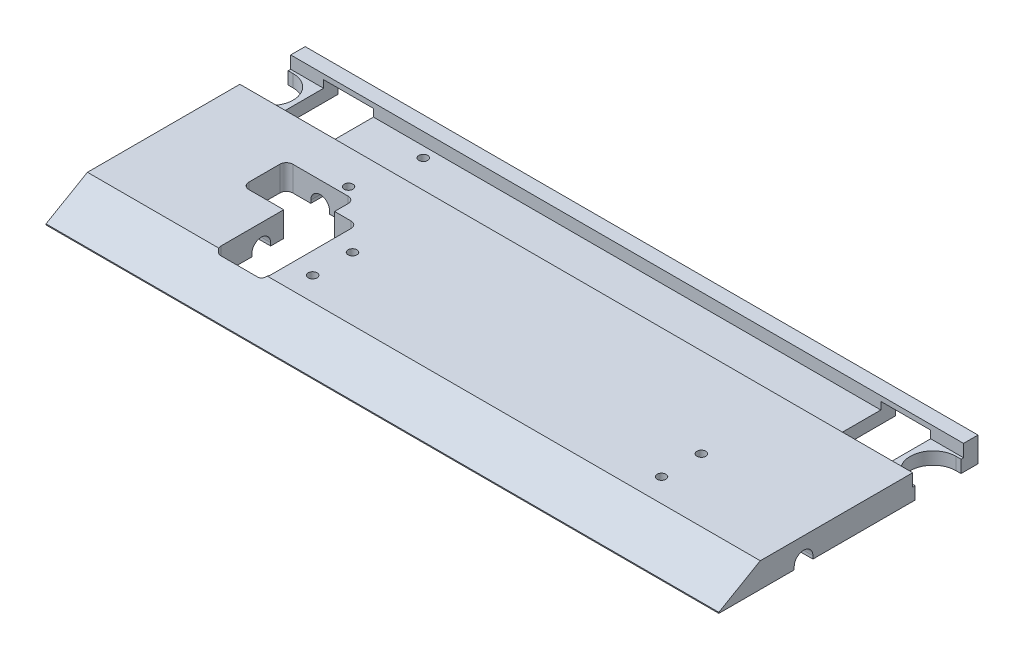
ISO-10303-21;
HEADER;
FILE_DESCRIPTION(('STEP AP214'),'2;1');
FILE_NAME('part.step','',(''),(''),'','','');
FILE_SCHEMA(('AUTOMOTIVE_DESIGN { 1 0 10303 214 1 1 1 1 }'));
ENDSEC;
DATA;
#1=APPLICATION_CONTEXT('core data for automotive mechanical design processes');
#2=APPLICATION_PROTOCOL_DEFINITION('international standard','automotive_design',2000,#1);
#3=PRODUCT_CONTEXT('',#1,'mechanical');
#4=PRODUCT('Part','Part','',(#3));
#5=PRODUCT_RELATED_PRODUCT_CATEGORY('part','',(#4));
#6=PRODUCT_DEFINITION_FORMATION('','',#4);
#7=PRODUCT_DEFINITION_CONTEXT('part definition',#1,'design');
#8=PRODUCT_DEFINITION('design','',#6,#7);
#9=PRODUCT_DEFINITION_SHAPE('','',#8);
#10=(LENGTH_UNIT() NAMED_UNIT(*) SI_UNIT(.MILLI.,.METRE.));
#11=(NAMED_UNIT(*) PLANE_ANGLE_UNIT() SI_UNIT($,.RADIAN.));
#12=(NAMED_UNIT(*) SI_UNIT($,.STERADIAN.) SOLID_ANGLE_UNIT());
#13=UNCERTAINTY_MEASURE_WITH_UNIT(LENGTH_MEASURE(1.E-05),#10,'distance_accuracy_value','');
#14=(GEOMETRIC_REPRESENTATION_CONTEXT(3) GLOBAL_UNCERTAINTY_ASSIGNED_CONTEXT((#13)) GLOBAL_UNIT_ASSIGNED_CONTEXT((#10,
#11,#12)) REPRESENTATION_CONTEXT('',''));
#15=CARTESIAN_POINT('',(0.,0.,0.));
#16=DIRECTION('',(0.,0.,1.));
#17=DIRECTION('',(1.,0.,0.));
#18=AXIS2_PLACEMENT_3D('',#15,#16,#17);
#19=CARTESIAN_POINT('',(0.,0.,0.));
#20=DIRECTION('',(0.,1.,0.));
#21=DIRECTION('',(0.,0.,1.));
#22=AXIS2_PLACEMENT_3D('',#19,#20,#21);
#23=PLANE('',#22);
#24=CARTESIAN_POINT('',(-34.29,0.,5.08));
#25=DIRECTION('',(0.,-1.,0.));
#26=DIRECTION('',(0.,0.,-1.));
#27=AXIS2_PLACEMENT_3D('',#24,#25,#26);
#28=CIRCLE('',#27,1.1303);
#29=CARTESIAN_POINT('',(-34.29,0.,3.9497));
#30=VERTEX_POINT('',#29);
#31=EDGE_CURVE('E600',#30,#30,#28,.T.);
#32=ORIENTED_EDGE('',*,*,#31,.F.);
#33=EDGE_LOOP('',(#32));
#34=FACE_BOUND('',#33,.T.);
#35=CARTESIAN_POINT('',(54.61,0.,5.08));
#36=DIRECTION('',(0.,-1.,0.));
#37=DIRECTION('',(0.,0.,-1.));
#38=AXIS2_PLACEMENT_3D('',#35,#36,#37);
#39=CIRCLE('',#38,1.1303);
#40=CARTESIAN_POINT('',(54.61,0.,3.9497));
#41=VERTEX_POINT('',#40);
#42=EDGE_CURVE('E588',#41,#41,#39,.T.);
#43=ORIENTED_EDGE('',*,*,#42,.F.);
#44=EDGE_LOOP('',(#43));
#45=FACE_BOUND('',#44,.T.);
#46=DIRECTION('',(0.,0.,1.));
#47=VECTOR('',#46,1.);
#48=CARTESIAN_POINT('',(-85.725,0.,0.));
#49=LINE('',#48,#47);
#50=CARTESIAN_POINT('',(-85.725,0.,2.38125));
#51=VERTEX_POINT('',#50);
#52=CARTESIAN_POINT('',(-85.725,0.,21.59));
#53=VERTEX_POINT('',#52);
#54=EDGE_CURVE('E1085',#51,#53,#49,.T.);
#55=ORIENTED_EDGE('',*,*,#54,.F.);
#56=DIRECTION('',(1.,0.,0.));
#57=VECTOR('',#56,1.);
#58=CARTESIAN_POINT('',(-85.725,0.,2.38125));
#59=LINE('',#58,#57);
#60=CARTESIAN_POINT('',(-77.343,0.,2.38125));
#61=VERTEX_POINT('',#60);
#62=EDGE_CURVE('E860',#51,#61,#59,.T.);
#63=ORIENTED_EDGE('',*,*,#62,.T.);
#64=DIRECTION('',(0.,0.,-1.));
#65=VECTOR('',#64,1.);
#66=CARTESIAN_POINT('',(-77.343,0.,-44.45));
#67=LINE('',#66,#65);
#68=CARTESIAN_POINT('',(-77.343,0.,11.176));
#69=VERTEX_POINT('',#68);
#70=EDGE_CURVE('E692',#69,#61,#67,.T.);
#71=ORIENTED_EDGE('',*,*,#70,.F.);
#72=CARTESIAN_POINT('',(-77.089,0.,11.176));
#73=DIRECTION('',(0.,-1.,0.));
#74=DIRECTION('',(0.,0.,-1.));
#75=AXIS2_PLACEMENT_3D('',#72,#73,#74);
#76=CIRCLE('',#75,0.253999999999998);
#77=CARTESIAN_POINT('',(-77.089,0.,11.43));
#78=VERTEX_POINT('',#77);
#79=EDGE_CURVE('E697',#78,#69,#76,.T.);
#80=ORIENTED_EDGE('',*,*,#79,.F.);
#81=DIRECTION('',(-1.,0.,0.));
#82=VECTOR('',#81,1.);
#83=CARTESIAN_POINT('',(-64.897,0.,11.43));
#84=LINE('',#83,#82);
#85=CARTESIAN_POINT('',(-64.897,0.,11.43));
#86=VERTEX_POINT('',#85);
#87=EDGE_CURVE('E700',#86,#78,#84,.T.);
#88=ORIENTED_EDGE('',*,*,#87,.F.);
#89=CARTESIAN_POINT('',(-64.897,0.,11.176));
#90=DIRECTION('',(0.,-1.,0.));
#91=DIRECTION('',(0.,0.,-1.));
#92=AXIS2_PLACEMENT_3D('',#89,#90,#91);
#93=CIRCLE('',#92,0.254000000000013);
#94=CARTESIAN_POINT('',(-64.643,0.,11.176));
#95=VERTEX_POINT('',#94);
#96=EDGE_CURVE('E703',#95,#86,#93,.T.);
#97=ORIENTED_EDGE('',*,*,#96,.F.);
#98=DIRECTION('',(0.,0.,1.));
#99=VECTOR('',#98,1.);
#100=CARTESIAN_POINT('',(-64.643,0.,-44.45));
#101=LINE('',#100,#99);
#102=CARTESIAN_POINT('',(-64.643,0.,2.38125));
#103=VERTEX_POINT('',#102);
#104=EDGE_CURVE('E709',#103,#95,#101,.T.);
#105=ORIENTED_EDGE('',*,*,#104,.F.);
#106=CARTESIAN_POINT('',(-52.451,0.,2.38125));
#107=VERTEX_POINT('',#106);
#108=EDGE_CURVE('E875',#103,#107,#59,.T.);
#109=ORIENTED_EDGE('',*,*,#108,.T.);
#110=DIRECTION('',(0.,0.,-1.));
#111=VECTOR('',#110,1.);
#112=CARTESIAN_POINT('',(-52.451,0.,0.));
#113=LINE('',#112,#111);
#114=CARTESIAN_POINT('',(-52.451,0.,10.287));
#115=VERTEX_POINT('',#114);
#116=EDGE_CURVE('E909',#115,#107,#113,.T.);
#117=ORIENTED_EDGE('',*,*,#116,.F.);
#118=CARTESIAN_POINT('',(-50.8,0.,10.287));
#119=DIRECTION('',(0.,1.,0.));
#120=DIRECTION('',(0.,0.,1.));
#121=AXIS2_PLACEMENT_3D('',#118,#119,#120);
#122=CIRCLE('',#121,1.651);
#123=CARTESIAN_POINT('',(-50.8,0.,11.938));
#124=VERTEX_POINT('',#123);
#125=EDGE_CURVE('E925',#124,#115,#122,.F.);
#126=ORIENTED_EDGE('',*,*,#125,.F.);
#127=DIRECTION('',(-1.,0.,0.));
#128=VECTOR('',#127,1.);
#129=CARTESIAN_POINT('',(0.,0.,11.938));
#130=LINE('',#129,#128);
#131=CARTESIAN_POINT('',(-41.3766,0.,11.938));
#132=VERTEX_POINT('',#131);
#133=EDGE_CURVE('E1178',#132,#124,#130,.T.);
#134=ORIENTED_EDGE('',*,*,#133,.F.);
#135=CARTESIAN_POINT('',(-41.3766,0.,10.287));
#136=DIRECTION('',(0.,1.,0.));
#137=DIRECTION('',(0.,0.,1.));
#138=AXIS2_PLACEMENT_3D('',#135,#136,#137);
#139=CIRCLE('',#138,1.651);
#140=CARTESIAN_POINT('',(-39.7256,0.,10.287));
#141=VERTEX_POINT('',#140);
#142=EDGE_CURVE('E1174',#141,#132,#139,.F.);
#143=ORIENTED_EDGE('',*,*,#142,.F.);
#144=DIRECTION('',(0.,0.,1.));
#145=VECTOR('',#144,1.);
#146=CARTESIAN_POINT('',(-39.7256,0.,0.));
#147=LINE('',#146,#145);
#148=CARTESIAN_POINT('',(-39.7256,0.,2.38125));
#149=VERTEX_POINT('',#148);
#150=EDGE_CURVE('E1175',#149,#141,#147,.T.);
#151=ORIENTED_EDGE('',*,*,#150,.F.);
#152=CARTESIAN_POINT('',(64.643,0.,2.38125));
#153=VERTEX_POINT('',#152);
#154=EDGE_CURVE('E901',#149,#153,#59,.T.);
#155=ORIENTED_EDGE('',*,*,#154,.T.);
#156=DIRECTION('',(0.,0.,-1.));
#157=VECTOR('',#156,1.);
#158=CARTESIAN_POINT('',(64.643,0.,-44.45));
#159=LINE('',#158,#157);
#160=CARTESIAN_POINT('',(64.643,0.,11.176));
#161=VERTEX_POINT('',#160);
#162=EDGE_CURVE('E770',#161,#153,#159,.T.);
#163=ORIENTED_EDGE('',*,*,#162,.F.);
#164=CARTESIAN_POINT('',(64.897,0.,11.176));
#165=DIRECTION('',(0.,-1.,0.));
#166=DIRECTION('',(0.,0.,1.));
#167=AXIS2_PLACEMENT_3D('',#164,#165,#166);
#168=CIRCLE('',#167,0.254000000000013);
#169=CARTESIAN_POINT('',(64.897,0.,11.43));
#170=VERTEX_POINT('',#169);
#171=EDGE_CURVE('E757',#170,#161,#168,.T.);
#172=ORIENTED_EDGE('',*,*,#171,.F.);
#173=DIRECTION('',(-1.,0.,0.));
#174=VECTOR('',#173,1.);
#175=CARTESIAN_POINT('',(64.897,0.,11.43));
#176=LINE('',#175,#174);
#177=CARTESIAN_POINT('',(77.089,0.,11.43));
#178=VERTEX_POINT('',#177);
#179=EDGE_CURVE('E761',#178,#170,#176,.T.);
#180=ORIENTED_EDGE('',*,*,#179,.F.);
#181=CARTESIAN_POINT('',(77.089,0.,11.176));
#182=DIRECTION('',(0.,-1.,0.));
#183=DIRECTION('',(0.,0.,1.));
#184=AXIS2_PLACEMENT_3D('',#181,#182,#183);
#185=CIRCLE('',#184,0.254000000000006);
#186=CARTESIAN_POINT('',(77.343,0.,11.176));
#187=VERTEX_POINT('',#186);
#188=EDGE_CURVE('E764',#187,#178,#185,.T.);
#189=ORIENTED_EDGE('',*,*,#188,.F.);
#190=DIRECTION('',(0.,0.,1.));
#191=VECTOR('',#190,1.);
#192=CARTESIAN_POINT('',(77.343,0.,-44.45));
#193=LINE('',#192,#191);
#194=CARTESIAN_POINT('',(77.343,0.,2.38125));
#195=VERTEX_POINT('',#194);
#196=EDGE_CURVE('E769',#195,#187,#193,.T.);
#197=ORIENTED_EDGE('',*,*,#196,.F.);
#198=CARTESIAN_POINT('',(85.725,0.,2.38125));
#199=VERTEX_POINT('',#198);
#200=EDGE_CURVE('E871',#195,#199,#59,.T.);
#201=ORIENTED_EDGE('',*,*,#200,.T.);
#202=DIRECTION('',(0.,0.,1.));
#203=VECTOR('',#202,1.);
#204=CARTESIAN_POINT('',(85.725,0.,0.));
#205=LINE('',#204,#203);
#206=CARTESIAN_POINT('',(85.725,0.,21.59));
#207=VERTEX_POINT('',#206);
#208=EDGE_CURVE('E514',#199,#207,#205,.T.);
#209=ORIENTED_EDGE('',*,*,#208,.T.);
#210=DIRECTION('',(1.,0.,0.));
#211=VECTOR('',#210,1.);
#212=CARTESIAN_POINT('',(0.,0.,21.59));
#213=LINE('',#212,#211);
#214=EDGE_CURVE('E519',#53,#207,#213,.T.);
#215=ORIENTED_EDGE('',*,*,#214,.F.);
#216=EDGE_LOOP('',(#55,#63,#71,#80,#88,#97,#105,#109,#117,#126,#134,#143,#151,#155,#163,#172,
#180,#189,#197,#201,#209,#215));
#217=FACE_BOUND('',#216,.T.);
#218=ADVANCED_FACE('F37',(#34,#45,#217),#23,.F.);
#219=CARTESIAN_POINT('',(85.725,0.,-28.448));
#220=VERTEX_POINT('',#219);
#221=CARTESIAN_POINT('',(85.725,0.,-2.38125));
#222=VERTEX_POINT('',#221);
#223=EDGE_CURVE('E505',#220,#222,#205,.T.);
#224=ORIENTED_EDGE('',*,*,#223,.T.);
#225=DIRECTION('',(1.,0.,0.));
#226=VECTOR('',#225,1.);
#227=CARTESIAN_POINT('',(-85.725,0.,-2.38125));
#228=LINE('',#227,#226);
#229=CARTESIAN_POINT('',(77.343,0.,-2.38125));
#230=VERTEX_POINT('',#229);
#231=EDGE_CURVE('E486',#230,#222,#228,.T.);
#232=ORIENTED_EDGE('',*,*,#231,.F.);
#233=CARTESIAN_POINT('',(77.343,0.,-44.45));
#234=VERTEX_POINT('',#233);
#235=EDGE_CURVE('E767',#234,#230,#193,.T.);
#236=ORIENTED_EDGE('',*,*,#235,.F.);
#237=DIRECTION('',(1.,0.,0.));
#238=VECTOR('',#237,1.);
#239=CARTESIAN_POINT('',(0.,0.,-44.45));
#240=LINE('',#239,#238);
#241=CARTESIAN_POINT('',(85.725,0.,-44.45));
#242=VERTEX_POINT('',#241);
#243=EDGE_CURVE('E523',#234,#242,#240,.T.);
#244=ORIENTED_EDGE('',*,*,#243,.T.);
#245=CARTESIAN_POINT('',(85.725,0.,-40.132));
#246=VERTEX_POINT('',#245);
#247=EDGE_CURVE('E516',#242,#246,#205,.T.);
#248=ORIENTED_EDGE('',*,*,#247,.T.);
#249=DIRECTION('',(1.,0.,0.));
#250=VECTOR('',#249,1.);
#251=CARTESIAN_POINT('',(0.,0.,-40.132));
#252=LINE('',#251,#250);
#253=CARTESIAN_POINT('',(84.455,0.,-40.132));
#254=VERTEX_POINT('',#253);
#255=EDGE_CURVE('E524',#254,#246,#252,.T.);
#256=ORIENTED_EDGE('',*,*,#255,.F.);
#257=CARTESIAN_POINT('',(84.455,0.,-34.29));
#258=DIRECTION('',(0.,1.,0.));
#259=DIRECTION('',(0.,0.,1.));
#260=AXIS2_PLACEMENT_3D('',#257,#258,#259);
#261=CIRCLE('',#260,5.84200000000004);
#262=CARTESIAN_POINT('',(84.455,0.,-28.448));
#263=VERTEX_POINT('',#262);
#264=EDGE_CURVE('E530',#254,#263,#261,.T.);
#265=ORIENTED_EDGE('',*,*,#264,.T.);
#266=DIRECTION('',(1.,0.,0.));
#267=VECTOR('',#266,1.);
#268=CARTESIAN_POINT('',(0.,0.,-28.448));
#269=LINE('',#268,#267);
#270=EDGE_CURVE('E513',#263,#220,#269,.T.);
#271=ORIENTED_EDGE('',*,*,#270,.T.);
#272=EDGE_LOOP('',(#224,#232,#236,#244,#248,#256,#265,#271));
#273=FACE_BOUND('',#272,.T.);
#274=ADVANCED_FACE('F510',(#273),#23,.F.);
#275=CARTESIAN_POINT('',(-49.276,0.,-19.05));
#276=DIRECTION('',(0.,-1.,0.));
#277=DIRECTION('',(0.,0.,-1.));
#278=AXIS2_PLACEMENT_3D('',#275,#276,#277);
#279=CIRCLE('',#278,1.1303);
#280=CARTESIAN_POINT('',(-49.276,0.,-20.1803));
#281=VERTEX_POINT('',#280);
#282=EDGE_CURVE('E615',#281,#281,#279,.T.);
#283=ORIENTED_EDGE('',*,*,#282,.F.);
#284=EDGE_LOOP('',(#283));
#285=FACE_BOUND('',#284,.T.);
#286=CARTESIAN_POINT('',(-49.276,0.,-38.1));
#287=DIRECTION('',(0.,-1.,0.));
#288=DIRECTION('',(0.,0.,-1.));
#289=AXIS2_PLACEMENT_3D('',#286,#287,#288);
#290=CIRCLE('',#289,1.1303);
#291=CARTESIAN_POINT('',(-49.276,0.,-39.2303));
#292=VERTEX_POINT('',#291);
#293=EDGE_CURVE('E609',#292,#292,#290,.T.);
#294=ORIENTED_EDGE('',*,*,#293,.F.);
#295=EDGE_LOOP('',(#294));
#296=FACE_BOUND('',#295,.T.);
#297=CARTESIAN_POINT('',(-34.29,0.,-5.08));
#298=DIRECTION('',(0.,-1.,0.));
#299=DIRECTION('',(0.,0.,-1.));
#300=AXIS2_PLACEMENT_3D('',#297,#298,#299);
#301=CIRCLE('',#300,1.1303);
#302=CARTESIAN_POINT('',(-34.29,0.,-6.2103));
#303=VERTEX_POINT('',#302);
#304=EDGE_CURVE('E606',#303,#303,#301,.T.);
#305=ORIENTED_EDGE('',*,*,#304,.F.);
#306=EDGE_LOOP('',(#305));
#307=FACE_BOUND('',#306,.T.);
#308=CARTESIAN_POINT('',(54.61,0.,-5.08));
#309=DIRECTION('',(0.,-1.,0.));
#310=DIRECTION('',(0.,0.,-1.));
#311=AXIS2_PLACEMENT_3D('',#308,#309,#310);
#312=CIRCLE('',#311,1.1303);
#313=CARTESIAN_POINT('',(54.61,0.,-6.2103));
#314=VERTEX_POINT('',#313);
#315=EDGE_CURVE('E594',#314,#314,#312,.T.);
#316=ORIENTED_EDGE('',*,*,#315,.F.);
#317=EDGE_LOOP('',(#316));
#318=FACE_BOUND('',#317,.T.);
#319=CARTESIAN_POINT('',(64.643,0.,-2.38125));
#320=VERTEX_POINT('',#319);
#321=CARTESIAN_POINT('',(64.643,0.,-44.45));
#322=VERTEX_POINT('',#321);
#323=EDGE_CURVE('E773',#320,#322,#159,.T.);
#324=ORIENTED_EDGE('',*,*,#323,.F.);
#325=CARTESIAN_POINT('',(-39.7256,0.,-2.38125));
#326=VERTEX_POINT('',#325);
#327=EDGE_CURVE('E497',#326,#320,#228,.T.);
#328=ORIENTED_EDGE('',*,*,#327,.F.);
#329=CARTESIAN_POINT('',(-39.7256,0.,-10.16));
#330=VERTEX_POINT('',#329);
#331=EDGE_CURVE('E1169',#330,#326,#147,.T.);
#332=ORIENTED_EDGE('',*,*,#331,.F.);
#333=CARTESIAN_POINT('',(-41.3766,0.,-10.16));
#334=DIRECTION('',(0.,1.,0.));
#335=DIRECTION('',(0.,0.,1.));
#336=AXIS2_PLACEMENT_3D('',#333,#334,#335);
#337=CIRCLE('',#336,1.651);
#338=CARTESIAN_POINT('',(-41.3766,0.,-11.811));
#339=VERTEX_POINT('',#338);
#340=EDGE_CURVE('E1180',#339,#330,#337,.F.);
#341=ORIENTED_EDGE('',*,*,#340,.F.);
#342=DIRECTION('',(1.,0.,0.));
#343=VECTOR('',#342,1.);
#344=CARTESIAN_POINT('',(0.,0.,-11.811));
#345=LINE('',#344,#343);
#346=CARTESIAN_POINT('',(-45.593,0.,-11.811));
#347=VERTEX_POINT('',#346);
#348=EDGE_CURVE('E1882',#347,#339,#345,.T.);
#349=ORIENTED_EDGE('',*,*,#348,.F.);
#350=DIRECTION('',(0.,0.,1.));
#351=VECTOR('',#350,1.);
#352=CARTESIAN_POINT('',(-45.593,0.,0.));
#353=LINE('',#352,#351);
#354=CARTESIAN_POINT('',(-45.593,0.,-15.2654));
#355=VERTEX_POINT('',#354);
#356=EDGE_CURVE('E1880',#355,#347,#353,.T.);
#357=ORIENTED_EDGE('',*,*,#356,.F.);
#358=CARTESIAN_POINT('',(-47.244,0.,-15.2654));
#359=DIRECTION('',(0.,1.,0.));
#360=DIRECTION('',(0.,0.,1.));
#361=AXIS2_PLACEMENT_3D('',#358,#359,#360);
#362=CIRCLE('',#361,1.651);
#363=CARTESIAN_POINT('',(-47.244,0.,-16.9164));
#364=VERTEX_POINT('',#363);
#365=EDGE_CURVE('E1877',#364,#355,#362,.F.);
#366=ORIENTED_EDGE('',*,*,#365,.F.);
#367=DIRECTION('',(1.,0.,0.));
#368=VECTOR('',#367,1.);
#369=CARTESIAN_POINT('',(0.,0.,-16.9164));
#370=LINE('',#369,#368);
#371=CARTESIAN_POINT('',(-51.97475,0.,-16.9164));
#372=VERTEX_POINT('',#371);
#373=EDGE_CURVE('E1873',#372,#364,#370,.T.);
#374=ORIENTED_EDGE('',*,*,#373,.F.);
#375=DIRECTION('',(0.,0.,1.));
#376=VECTOR('',#375,1.);
#377=CARTESIAN_POINT('',(-51.97475,0.,-44.45));
#378=LINE('',#377,#376);
#379=CARTESIAN_POINT('',(-51.97475,0.,-44.45));
#380=VERTEX_POINT('',#379);
#381=EDGE_CURVE('E797',#380,#372,#378,.T.);
#382=ORIENTED_EDGE('',*,*,#381,.F.);
#383=EDGE_CURVE('E527',#380,#322,#240,.T.);
#384=ORIENTED_EDGE('',*,*,#383,.T.);
#385=EDGE_LOOP('',(#324,#328,#332,#341,#349,#357,#366,#374,#382,#384));
#386=FACE_BOUND('',#385,.T.);
#387=ADVANCED_FACE('F1114',(#285,#296,#307,#318,#386),#23,.F.);
#388=CARTESIAN_POINT('',(-52.451,0.,-2.38125));
#389=VERTEX_POINT('',#388);
#390=CARTESIAN_POINT('',(-52.451,0.,-5.715));
#391=VERTEX_POINT('',#390);
#392=EDGE_CURVE('E920',#389,#391,#113,.T.);
#393=ORIENTED_EDGE('',*,*,#392,.F.);
#394=CARTESIAN_POINT('',(-64.643,0.,-2.38125));
#395=VERTEX_POINT('',#394);
#396=EDGE_CURVE('E863',#395,#389,#228,.T.);
#397=ORIENTED_EDGE('',*,*,#396,.F.);
#398=CARTESIAN_POINT('',(-64.643,0.,-44.45));
#399=VERTEX_POINT('',#398);
#400=EDGE_CURVE('E706',#399,#395,#101,.T.);
#401=ORIENTED_EDGE('',*,*,#400,.F.);
#402=CARTESIAN_POINT('',(-56.73725,0.,-44.45));
#403=VERTEX_POINT('',#402);
#404=EDGE_CURVE('E528',#399,#403,#240,.T.);
#405=ORIENTED_EDGE('',*,*,#404,.T.);
#406=DIRECTION('',(0.,0.,1.));
#407=VECTOR('',#406,1.);
#408=CARTESIAN_POINT('',(-56.73725,0.,-44.45));
#409=LINE('',#408,#407);
#410=CARTESIAN_POINT('',(-56.73725,0.,-16.9164));
#411=VERTEX_POINT('',#410);
#412=EDGE_CURVE('E793',#403,#411,#409,.T.);
#413=ORIENTED_EDGE('',*,*,#412,.T.);
#414=CARTESIAN_POINT('',(-61.341,0.,-16.9164));
#415=VERTEX_POINT('',#414);
#416=EDGE_CURVE('E1874',#415,#411,#370,.T.);
#417=ORIENTED_EDGE('',*,*,#416,.F.);
#418=CARTESIAN_POINT('',(-61.341,0.,-15.2654));
#419=DIRECTION('',(0.,1.,0.));
#420=DIRECTION('',(0.,0.,1.));
#421=AXIS2_PLACEMENT_3D('',#418,#419,#420);
#422=CIRCLE('',#421,1.651);
#423=CARTESIAN_POINT('',(-62.992,0.,-15.2654));
#424=VERTEX_POINT('',#423);
#425=EDGE_CURVE('E517',#415,#424,#422,.T.);
#426=ORIENTED_EDGE('',*,*,#425,.T.);
#427=DIRECTION('',(0.,0.,-1.));
#428=VECTOR('',#427,1.);
#429=CARTESIAN_POINT('',(-62.992,0.,0.));
#430=LINE('',#429,#428);
#431=CARTESIAN_POINT('',(-62.992,0.,-7.366));
#432=VERTEX_POINT('',#431);
#433=EDGE_CURVE('E585',#432,#424,#430,.T.);
#434=ORIENTED_EDGE('',*,*,#433,.F.);
#435=CARTESIAN_POINT('',(-61.341,0.,-7.366));
#436=DIRECTION('',(0.,1.,0.));
#437=DIRECTION('',(0.,0.,1.));
#438=AXIS2_PLACEMENT_3D('',#435,#436,#437);
#439=CIRCLE('',#438,1.651);
#440=CARTESIAN_POINT('',(-61.341,0.,-5.715));
#441=VERTEX_POINT('',#440);
#442=EDGE_CURVE('E923',#441,#432,#439,.F.);
#443=ORIENTED_EDGE('',*,*,#442,.F.);
#444=DIRECTION('',(-1.,0.,0.));
#445=VECTOR('',#444,1.);
#446=CARTESIAN_POINT('',(0.,0.,-5.715));
#447=LINE('',#446,#445);
#448=EDGE_CURVE('E919',#391,#441,#447,.T.);
#449=ORIENTED_EDGE('',*,*,#448,.F.);
#450=EDGE_LOOP('',(#393,#397,#401,#405,#413,#417,#426,#434,#443,#449));
#451=FACE_BOUND('',#450,.T.);
#452=ADVANCED_FACE('F1161',(#451),#23,.F.);
#453=CARTESIAN_POINT('',(0.,3.175,0.));
#454=DIRECTION('',(0.,-1.,0.));
#455=DIRECTION('',(0.,0.,-1.));
#456=AXIS2_PLACEMENT_3D('',#453,#454,#455);
#457=PLANE('',#456);
#458=CARTESIAN_POINT('',(-49.276,3.175,-38.1));
#459=DIRECTION('',(0.,-1.,0.));
#460=DIRECTION('',(0.,0.,-1.));
#461=AXIS2_PLACEMENT_3D('',#458,#459,#460);
#462=CIRCLE('',#461,1.1303);
#463=CARTESIAN_POINT('',(-49.276,3.175,-39.2303));
#464=VERTEX_POINT('',#463);
#465=EDGE_CURVE('E632',#464,#464,#462,.F.);
#466=ORIENTED_EDGE('',*,*,#465,.F.);
#467=EDGE_LOOP('',(#466));
#468=FACE_BOUND('',#467,.T.);
#469=DIRECTION('',(1.,0.,0.));
#470=VECTOR('',#469,1.);
#471=CARTESIAN_POINT('',(-85.725,3.175,-27.813));
#472=LINE('',#471,#470);
#473=CARTESIAN_POINT('',(-64.643,3.175,-27.813));
#474=VERTEX_POINT('',#473);
#475=CARTESIAN_POINT('',(64.643,3.175,-27.813));
#476=VERTEX_POINT('',#475);
#477=EDGE_CURVE('E660',#474,#476,#472,.T.);
#478=ORIENTED_EDGE('',*,*,#477,.T.);
#479=DIRECTION('',(0.,0.,-1.));
#480=VECTOR('',#479,1.);
#481=CARTESIAN_POINT('',(64.643,3.175,0.));
#482=LINE('',#481,#480);
#483=CARTESIAN_POINT('',(64.643,3.175,-40.767));
#484=VERTEX_POINT('',#483);
#485=EDGE_CURVE('E730',#476,#484,#482,.T.);
#486=ORIENTED_EDGE('',*,*,#485,.T.);
#487=DIRECTION('',(-1.,0.,0.));
#488=VECTOR('',#487,1.);
#489=CARTESIAN_POINT('',(-85.725,3.175,-40.767));
#490=LINE('',#489,#488);
#491=CARTESIAN_POINT('',(-64.643,3.175,-40.767));
#492=VERTEX_POINT('',#491);
#493=EDGE_CURVE('E652',#484,#492,#490,.T.);
#494=ORIENTED_EDGE('',*,*,#493,.T.);
#495=DIRECTION('',(0.,0.,1.));
#496=VECTOR('',#495,1.);
#497=CARTESIAN_POINT('',(-64.643,3.175,0.));
#498=LINE('',#497,#496);
#499=EDGE_CURVE('E666',#492,#474,#498,.T.);
#500=ORIENTED_EDGE('',*,*,#499,.T.);
#501=EDGE_LOOP('',(#478,#486,#494,#500));
#502=FACE_BOUND('',#501,.T.);
#503=ADVANCED_FACE('F1130',(#468,#502),#457,.F.);
#504=CARTESIAN_POINT('',(85.725,3.175,-40.767));
#505=VERTEX_POINT('',#504);
#506=CARTESIAN_POINT('',(77.343,3.175,-40.767));
#507=VERTEX_POINT('',#506);
#508=EDGE_CURVE('E636',#505,#507,#490,.T.);
#509=ORIENTED_EDGE('',*,*,#508,.T.);
#510=DIRECTION('',(0.,0.,1.));
#511=VECTOR('',#510,1.);
#512=CARTESIAN_POINT('',(77.343,3.175,0.));
#513=LINE('',#512,#511);
#514=CARTESIAN_POINT('',(77.343,3.175,-27.813));
#515=VERTEX_POINT('',#514);
#516=EDGE_CURVE('E736',#507,#515,#513,.T.);
#517=ORIENTED_EDGE('',*,*,#516,.T.);
#518=CARTESIAN_POINT('',(85.725,3.175,-27.813));
#519=VERTEX_POINT('',#518);
#520=EDGE_CURVE('E661',#515,#519,#472,.T.);
#521=ORIENTED_EDGE('',*,*,#520,.T.);
#522=DIRECTION('',(0.,0.,-1.));
#523=VECTOR('',#522,1.);
#524=CARTESIAN_POINT('',(85.725,3.175,-27.813));
#525=LINE('',#524,#523);
#526=CARTESIAN_POINT('',(85.725,3.175,-28.448));
#527=VERTEX_POINT('',#526);
#528=EDGE_CURVE('E654',#519,#527,#525,.T.);
#529=ORIENTED_EDGE('',*,*,#528,.T.);
#530=DIRECTION('',(-1.,0.,0.));
#531=VECTOR('',#530,1.);
#532=CARTESIAN_POINT('',(0.,3.175,-28.448));
#533=LINE('',#532,#531);
#534=CARTESIAN_POINT('',(84.455,3.175,-28.448));
#535=VERTEX_POINT('',#534);
#536=EDGE_CURVE('E630',#527,#535,#533,.T.);
#537=ORIENTED_EDGE('',*,*,#536,.T.);
#538=CARTESIAN_POINT('',(84.455,3.175,-34.29));
#539=DIRECTION('',(0.,-1.,0.));
#540=DIRECTION('',(0.,0.,-1.));
#541=AXIS2_PLACEMENT_3D('',#538,#539,#540);
#542=CIRCLE('',#541,5.84200000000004);
#543=CARTESIAN_POINT('',(84.455,3.175,-40.1320000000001));
#544=VERTEX_POINT('',#543);
#545=EDGE_CURVE('E628',#535,#544,#542,.T.);
#546=ORIENTED_EDGE('',*,*,#545,.T.);
#547=DIRECTION('',(-1.,0.,0.));
#548=VECTOR('',#547,1.);
#549=CARTESIAN_POINT('',(0.,3.175,-40.132));
#550=LINE('',#549,#548);
#551=CARTESIAN_POINT('',(85.725,3.175,-40.132));
#552=VERTEX_POINT('',#551);
#553=EDGE_CURVE('E625',#552,#544,#550,.T.);
#554=ORIENTED_EDGE('',*,*,#553,.F.);
#555=EDGE_CURVE('E656',#552,#505,#525,.T.);
#556=ORIENTED_EDGE('',*,*,#555,.T.);
#557=EDGE_LOOP('',(#509,#517,#521,#529,#537,#546,#554,#556));
#558=FACE_BOUND('',#557,.T.);
#559=ADVANCED_FACE('F1059',(#558),#457,.F.);
#560=CARTESIAN_POINT('',(0.,6.35,0.));
#561=DIRECTION('',(0.,1.,0.));
#562=DIRECTION('',(0.,0.,1.));
#563=AXIS2_PLACEMENT_3D('',#560,#561,#562);
#564=PLANE('',#563);
#565=DIRECTION('',(-1.,0.,0.));
#566=VECTOR('',#565,1.);
#567=CARTESIAN_POINT('',(-85.725,6.35,-40.767));
#568=LINE('',#567,#566);
#569=CARTESIAN_POINT('',(85.725,6.35,-40.767));
#570=VERTEX_POINT('',#569);
#571=CARTESIAN_POINT('',(-85.725,6.35,-40.767));
#572=VERTEX_POINT('',#571);
#573=EDGE_CURVE('E644',#570,#572,#568,.T.);
#574=ORIENTED_EDGE('',*,*,#573,.F.);
#575=DIRECTION('',(0.,0.,1.));
#576=VECTOR('',#575,1.);
#577=CARTESIAN_POINT('',(85.725,6.35,0.));
#578=LINE('',#577,#576);
#579=CARTESIAN_POINT('',(85.725,6.35,-44.45));
#580=VERTEX_POINT('',#579);
#581=EDGE_CURVE('E582',#580,#570,#578,.T.);
#582=ORIENTED_EDGE('',*,*,#581,.F.);
#583=DIRECTION('',(1.,0.,0.));
#584=VECTOR('',#583,1.);
#585=CARTESIAN_POINT('',(0.,6.35,-44.45));
#586=LINE('',#585,#584);
#587=CARTESIAN_POINT('',(-85.725,6.35,-44.45));
#588=VERTEX_POINT('',#587);
#589=EDGE_CURVE('E579',#588,#580,#586,.T.);
#590=ORIENTED_EDGE('',*,*,#589,.F.);
#591=DIRECTION('',(0.,0.,1.));
#592=VECTOR('',#591,1.);
#593=CARTESIAN_POINT('',(-85.725,6.35,0.));
#594=LINE('',#593,#592);
#595=EDGE_CURVE('E575',#588,#572,#594,.T.);
#596=ORIENTED_EDGE('',*,*,#595,.T.);
#597=EDGE_LOOP('',(#574,#582,#590,#596));
#598=FACE_BOUND('',#597,.T.);
#599=ADVANCED_FACE('F1224',(#598),#564,.T.);
#600=CARTESIAN_POINT('',(-77.343,0.,-2.38125));
#601=VERTEX_POINT('',#600);
#602=CARTESIAN_POINT('',(-77.343,0.,-44.45));
#603=VERTEX_POINT('',#602);
#604=EDGE_CURVE('E696',#601,#603,#67,.T.);
#605=ORIENTED_EDGE('',*,*,#604,.F.);
#606=CARTESIAN_POINT('',(-85.725,0.,-2.38125));
#607=VERTEX_POINT('',#606);
#608=EDGE_CURVE('E60',#607,#601,#228,.T.);
#609=ORIENTED_EDGE('',*,*,#608,.F.);
#610=CARTESIAN_POINT('',(-85.725,0.,-28.448));
#611=VERTEX_POINT('',#610);
#612=EDGE_CURVE('E1087',#611,#607,#49,.T.);
#613=ORIENTED_EDGE('',*,*,#612,.F.);
#614=DIRECTION('',(1.,0.,0.));
#615=VECTOR('',#614,1.);
#616=CARTESIAN_POINT('',(0.,0.,-28.448));
#617=LINE('',#616,#615);
#618=CARTESIAN_POINT('',(-84.455,0.,-28.448));
#619=VERTEX_POINT('',#618);
#620=EDGE_CURVE('E1088',#611,#619,#617,.T.);
#621=ORIENTED_EDGE('',*,*,#620,.T.);
#622=CARTESIAN_POINT('',(-84.455,0.,-34.29));
#623=DIRECTION('',(0.,1.,0.));
#624=DIRECTION('',(0.,0.,1.));
#625=AXIS2_PLACEMENT_3D('',#622,#623,#624);
#626=CIRCLE('',#625,5.84200000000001);
#627=CARTESIAN_POINT('',(-84.455,0.,-40.132));
#628=VERTEX_POINT('',#627);
#629=EDGE_CURVE('E1093',#619,#628,#626,.T.);
#630=ORIENTED_EDGE('',*,*,#629,.T.);
#631=DIRECTION('',(1.,0.,0.));
#632=VECTOR('',#631,1.);
#633=CARTESIAN_POINT('',(0.,0.,-40.132));
#634=LINE('',#633,#632);
#635=CARTESIAN_POINT('',(-85.725,0.,-40.132));
#636=VERTEX_POINT('',#635);
#637=EDGE_CURVE('E1097',#636,#628,#634,.T.);
#638=ORIENTED_EDGE('',*,*,#637,.F.);
#639=CARTESIAN_POINT('',(-85.725,0.,-44.45));
#640=VERTEX_POINT('',#639);
#641=EDGE_CURVE('E1090',#640,#636,#49,.T.);
#642=ORIENTED_EDGE('',*,*,#641,.F.);
#643=EDGE_CURVE('E1098',#640,#603,#240,.T.);
#644=ORIENTED_EDGE('',*,*,#643,.T.);
#645=EDGE_LOOP('',(#605,#609,#613,#621,#630,#638,#642,#644));
#646=FACE_BOUND('',#645,.T.);
#647=ADVANCED_FACE('F1214',(#646),#23,.F.);
#648=CARTESIAN_POINT('',(-61.341,6.35,-15.2654));
#649=DIRECTION('',(0.,-1.,0.));
#650=DIRECTION('',(0.,0.,-1.));
#651=AXIS2_PLACEMENT_3D('',#648,#649,#650);
#652=CYLINDRICAL_SURFACE('',#651,1.651);
#653=ORIENTED_EDGE('',*,*,#425,.F.);
#654=DIRECTION('',(0.,-1.,0.));
#655=VECTOR('',#654,1.);
#656=CARTESIAN_POINT('',(-61.341,6.35,-16.9164));
#657=LINE('',#656,#655);
#658=CARTESIAN_POINT('',(-61.341,6.35,-16.9164));
#659=VERTEX_POINT('',#658);
#660=EDGE_CURVE('E968',#659,#415,#657,.T.);
#661=ORIENTED_EDGE('',*,*,#660,.F.);
#662=CARTESIAN_POINT('',(-61.341,6.35,-15.2654));
#663=DIRECTION('',(0.,1.,0.));
#664=DIRECTION('',(0.,0.,1.));
#665=AXIS2_PLACEMENT_3D('',#662,#663,#664);
#666=CIRCLE('',#665,1.651);
#667=CARTESIAN_POINT('',(-62.992,6.35,-15.2654));
#668=VERTEX_POINT('',#667);
#669=EDGE_CURVE('E571',#659,#668,#666,.T.);
#670=ORIENTED_EDGE('',*,*,#669,.T.);
#671=DIRECTION('',(0.,-1.,0.));
#672=VECTOR('',#671,1.);
#673=CARTESIAN_POINT('',(-62.992,6.35,-15.2654));
#674=LINE('',#673,#672);
#675=EDGE_CURVE('E933',#668,#424,#674,.T.);
#676=ORIENTED_EDGE('',*,*,#675,.T.);
#677=EDGE_LOOP('',(#653,#661,#670,#676));
#678=FACE_BOUND('',#677,.T.);
#679=ADVANCED_FACE('F1223',(#678),#652,.F.);
#680=CARTESIAN_POINT('',(0.,6.35,-16.9164));
#681=DIRECTION('',(0.,0.,-1.));
#682=DIRECTION('',(-1.,0.,0.));
#683=AXIS2_PLACEMENT_3D('',#680,#681,#682);
#684=PLANE('',#683);
#685=CARTESIAN_POINT('',(-54.356,0.762,-16.9164));
#686=DIRECTION('',(0.,0.,1.));
#687=DIRECTION('',(1.,0.,0.));
#688=AXIS2_PLACEMENT_3D('',#685,#686,#687);
#689=CIRCLE('',#688,2.38125);
#690=CARTESIAN_POINT('',(-51.97475,0.762,-16.9164));
#691=VERTEX_POINT('',#690);
#692=CARTESIAN_POINT('',(-56.73725,0.762,-16.9164));
#693=VERTEX_POINT('',#692);
#694=EDGE_CURVE('E807',#691,#693,#689,.T.);
#695=ORIENTED_EDGE('',*,*,#694,.F.);
#696=DIRECTION('',(0.,1.,0.));
#697=VECTOR('',#696,1.);
#698=CARTESIAN_POINT('',(-51.97475,0.,-16.9164));
#699=LINE('',#698,#697);
#700=EDGE_CURVE('E801',#372,#691,#699,.T.);
#701=ORIENTED_EDGE('',*,*,#700,.F.);
#702=ORIENTED_EDGE('',*,*,#373,.T.);
#703=DIRECTION('',(0.,-1.,0.));
#704=VECTOR('',#703,1.);
#705=CARTESIAN_POINT('',(-47.244,6.35,-16.9164));
#706=LINE('',#705,#704);
#707=CARTESIAN_POINT('',(-47.244,6.35,-16.9164));
#708=VERTEX_POINT('',#707);
#709=EDGE_CURVE('E965',#708,#364,#706,.T.);
#710=ORIENTED_EDGE('',*,*,#709,.F.);
#711=DIRECTION('',(1.,0.,0.));
#712=VECTOR('',#711,1.);
#713=CARTESIAN_POINT('',(0.,6.35,-16.9164));
#714=LINE('',#713,#712);
#715=EDGE_CURVE('E568',#659,#708,#714,.T.);
#716=ORIENTED_EDGE('',*,*,#715,.F.);
#717=ORIENTED_EDGE('',*,*,#660,.T.);
#718=ORIENTED_EDGE('',*,*,#416,.T.);
#719=DIRECTION('',(0.,-1.,0.));
#720=VECTOR('',#719,1.);
#721=CARTESIAN_POINT('',(-56.73725,0.,-16.9164));
#722=LINE('',#721,#720);
#723=EDGE_CURVE('E805',#693,#411,#722,.T.);
#724=ORIENTED_EDGE('',*,*,#723,.F.);
#725=EDGE_LOOP('',(#695,#701,#702,#710,#716,#717,#718,#724));
#726=FACE_BOUND('',#725,.T.);
#727=ADVANCED_FACE('F1229',(#726),#684,.F.);
#728=CARTESIAN_POINT('',(-47.244,6.35,-15.2654));
#729=DIRECTION('',(0.,-1.,0.));
#730=DIRECTION('',(0.,0.,-1.));
#731=AXIS2_PLACEMENT_3D('',#728,#729,#730);
#732=CYLINDRICAL_SURFACE('',#731,1.651);
#733=ORIENTED_EDGE('',*,*,#365,.T.);
#734=DIRECTION('',(0.,-1.,0.));
#735=VECTOR('',#734,1.);
#736=CARTESIAN_POINT('',(-45.593,6.35,-15.2654));
#737=LINE('',#736,#735);
#738=CARTESIAN_POINT('',(-45.593,6.35,-15.2654));
#739=VERTEX_POINT('',#738);
#740=EDGE_CURVE('E962',#739,#355,#737,.T.);
#741=ORIENTED_EDGE('',*,*,#740,.F.);
#742=CARTESIAN_POINT('',(-47.244,6.35,-15.2654));
#743=DIRECTION('',(0.,1.,0.));
#744=DIRECTION('',(0.,0.,1.));
#745=AXIS2_PLACEMENT_3D('',#742,#743,#744);
#746=CIRCLE('',#745,1.651);
#747=EDGE_CURVE('E565',#708,#739,#746,.F.);
#748=ORIENTED_EDGE('',*,*,#747,.F.);
#749=ORIENTED_EDGE('',*,*,#709,.T.);
#750=EDGE_LOOP('',(#733,#741,#748,#749));
#751=FACE_BOUND('',#750,.T.);
#752=ADVANCED_FACE('F1551',(#751),#732,.F.);
#753=CARTESIAN_POINT('',(-45.593,6.35,0.));
#754=DIRECTION('',(1.,0.,0.));
#755=DIRECTION('',(0.,0.,-1.));
#756=AXIS2_PLACEMENT_3D('',#753,#754,#755);
#757=PLANE('',#756);
#758=ORIENTED_EDGE('',*,*,#356,.T.);
#759=DIRECTION('',(0.,-1.,0.));
#760=VECTOR('',#759,1.);
#761=CARTESIAN_POINT('',(-45.593,6.35,-11.811));
#762=LINE('',#761,#760);
#763=CARTESIAN_POINT('',(-45.593,6.35,-11.811));
#764=VERTEX_POINT('',#763);
#765=EDGE_CURVE('E959',#764,#347,#762,.T.);
#766=ORIENTED_EDGE('',*,*,#765,.F.);
#767=DIRECTION('',(0.,0.,1.));
#768=VECTOR('',#767,1.);
#769=CARTESIAN_POINT('',(-45.593,6.35,0.));
#770=LINE('',#769,#768);
#771=EDGE_CURVE('E562',#739,#764,#770,.T.);
#772=ORIENTED_EDGE('',*,*,#771,.F.);
#773=ORIENTED_EDGE('',*,*,#740,.T.);
#774=EDGE_LOOP('',(#758,#766,#772,#773));
#775=FACE_BOUND('',#774,.T.);
#776=ADVANCED_FACE('F1565',(#775),#757,.F.);
#777=CARTESIAN_POINT('',(0.,6.35,-11.811));
#778=DIRECTION('',(0.,0.,-1.));
#779=DIRECTION('',(-1.,0.,0.));
#780=AXIS2_PLACEMENT_3D('',#777,#778,#779);
#781=PLANE('',#780);
#782=ORIENTED_EDGE('',*,*,#348,.T.);
#783=DIRECTION('',(0.,-1.,0.));
#784=VECTOR('',#783,1.);
#785=CARTESIAN_POINT('',(-41.3766,6.35,-11.811));
#786=LINE('',#785,#784);
#787=CARTESIAN_POINT('',(-41.3766,6.35,-11.811));
#788=VERTEX_POINT('',#787);
#789=EDGE_CURVE('E956',#788,#339,#786,.T.);
#790=ORIENTED_EDGE('',*,*,#789,.F.);
#791=DIRECTION('',(1.,0.,0.));
#792=VECTOR('',#791,1.);
#793=CARTESIAN_POINT('',(0.,6.35,-11.811));
#794=LINE('',#793,#792);
#795=EDGE_CURVE('E559',#764,#788,#794,.T.);
#796=ORIENTED_EDGE('',*,*,#795,.F.);
#797=ORIENTED_EDGE('',*,*,#765,.T.);
#798=EDGE_LOOP('',(#782,#790,#796,#797));
#799=FACE_BOUND('',#798,.T.);
#800=ADVANCED_FACE('F1572',(#799),#781,.F.);
#801=CARTESIAN_POINT('',(-41.3766,6.35,-10.16));
#802=DIRECTION('',(0.,-1.,0.));
#803=DIRECTION('',(0.,0.,-1.));
#804=AXIS2_PLACEMENT_3D('',#801,#802,#803);
#805=CYLINDRICAL_SURFACE('',#804,1.651);
#806=ORIENTED_EDGE('',*,*,#340,.T.);
#807=DIRECTION('',(0.,-1.,0.));
#808=VECTOR('',#807,1.);
#809=CARTESIAN_POINT('',(-39.7256,6.35,-10.16));
#810=LINE('',#809,#808);
#811=CARTESIAN_POINT('',(-39.7256,6.35,-10.16));
#812=VERTEX_POINT('',#811);
#813=EDGE_CURVE('E953',#812,#330,#810,.T.);
#814=ORIENTED_EDGE('',*,*,#813,.F.);
#815=CARTESIAN_POINT('',(-41.3766,6.35,-10.16));
#816=DIRECTION('',(0.,1.,0.));
#817=DIRECTION('',(0.,0.,1.));
#818=AXIS2_PLACEMENT_3D('',#815,#816,#817);
#819=CIRCLE('',#818,1.651);
#820=EDGE_CURVE('E556',#788,#812,#819,.F.);
#821=ORIENTED_EDGE('',*,*,#820,.F.);
#822=ORIENTED_EDGE('',*,*,#789,.T.);
#823=EDGE_LOOP('',(#806,#814,#821,#822));
#824=FACE_BOUND('',#823,.T.);
#825=ADVANCED_FACE('F1580',(#824),#805,.F.);
#826=CARTESIAN_POINT('',(-39.7256,6.35,0.));
#827=DIRECTION('',(1.,0.,0.));
#828=DIRECTION('',(0.,0.,-1.));
#829=AXIS2_PLACEMENT_3D('',#826,#827,#828);
#830=PLANE('',#829);
#831=CARTESIAN_POINT('',(-39.7256,0.762,0.));
#832=DIRECTION('',(1.,0.,0.));
#833=DIRECTION('',(0.,0.,-1.));
#834=AXIS2_PLACEMENT_3D('',#831,#832,#833);
#835=CIRCLE('',#834,2.38125);
#836=CARTESIAN_POINT('',(-39.7256,0.762,-2.38125));
#837=VERTEX_POINT('',#836);
#838=CARTESIAN_POINT('',(-39.7256,0.762,2.38125));
#839=VERTEX_POINT('',#838);
#840=EDGE_CURVE('E832',#837,#839,#835,.T.);
#841=ORIENTED_EDGE('',*,*,#840,.T.);
#842=DIRECTION('',(0.,-1.,0.));
#843=VECTOR('',#842,1.);
#844=CARTESIAN_POINT('',(-39.7256,6.35,2.38124999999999));
#845=LINE('',#844,#843);
#846=EDGE_CURVE('E810',#839,#149,#845,.T.);
#847=ORIENTED_EDGE('',*,*,#846,.T.);
#848=ORIENTED_EDGE('',*,*,#150,.T.);
#849=DIRECTION('',(0.,-1.,0.));
#850=VECTOR('',#849,1.);
#851=CARTESIAN_POINT('',(-39.7256,6.35,10.287));
#852=LINE('',#851,#850);
#853=CARTESIAN_POINT('',(-39.7256,6.35,10.287));
#854=VERTEX_POINT('',#853);
#855=EDGE_CURVE('E950',#854,#141,#852,.T.);
#856=ORIENTED_EDGE('',*,*,#855,.F.);
#857=DIRECTION('',(0.,0.,1.));
#858=VECTOR('',#857,1.);
#859=CARTESIAN_POINT('',(-39.7256,6.35,0.));
#860=LINE('',#859,#858);
#861=EDGE_CURVE('E553',#812,#854,#860,.T.);
#862=ORIENTED_EDGE('',*,*,#861,.F.);
#863=ORIENTED_EDGE('',*,*,#813,.T.);
#864=ORIENTED_EDGE('',*,*,#331,.T.);
#865=DIRECTION('',(0.,1.,0.));
#866=VECTOR('',#865,1.);
#867=CARTESIAN_POINT('',(-39.7256,6.35,-2.38124999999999));
#868=LINE('',#867,#866);
#869=EDGE_CURVE('E847',#326,#837,#868,.T.);
#870=ORIENTED_EDGE('',*,*,#869,.T.);
#871=EDGE_LOOP('',(#841,#847,#848,#856,#862,#863,#864,#870));
#872=FACE_BOUND('',#871,.T.);
#873=ADVANCED_FACE('F1171',(#872),#830,.F.);
#874=CARTESIAN_POINT('',(-41.3766,6.35,10.287));
#875=DIRECTION('',(0.,-1.,0.));
#876=DIRECTION('',(0.,0.,-1.));
#877=AXIS2_PLACEMENT_3D('',#874,#875,#876);
#878=CYLINDRICAL_SURFACE('',#877,1.651);
#879=DIRECTION('',(0.,-1.,0.));
#880=VECTOR('',#879,1.);
#881=CARTESIAN_POINT('',(-41.3766,6.35,11.938));
#882=LINE('',#881,#880);
#883=CARTESIAN_POINT('',(-41.3766,5.82658479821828,11.938));
#884=VERTEX_POINT('',#883);
#885=EDGE_CURVE('E948',#884,#132,#882,.T.);
#886=ORIENTED_EDGE('',*,*,#885,.F.);
#887=CARTESIAN_POINT('',(-41.3766,6.77979009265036,10.287));
#888=DIRECTION('',(0.,0.866025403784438,0.500000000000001));
#889=DIRECTION('',(0.,-0.500000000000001,0.866025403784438));
#890=AXIS2_PLACEMENT_3D('',#887,#888,#889);
#891=ELLIPSE('',#890,1.90641058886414,1.651);
#892=CARTESIAN_POINT('',(-39.9029506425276,6.35,11.0314182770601));
#893=VERTEX_POINT('',#892);
#894=EDGE_CURVE('E1004',#884,#893,#891,.T.);
#895=ORIENTED_EDGE('',*,*,#894,.T.);
#896=CARTESIAN_POINT('',(-41.3766,6.35,10.287));
#897=DIRECTION('',(0.,1.,0.));
#898=DIRECTION('',(0.,0.,1.));
#899=AXIS2_PLACEMENT_3D('',#896,#897,#898);
#900=CIRCLE('',#899,1.651);
#901=EDGE_CURVE('E550',#854,#893,#900,.F.);
#902=ORIENTED_EDGE('',*,*,#901,.F.);
#903=ORIENTED_EDGE('',*,*,#855,.T.);
#904=ORIENTED_EDGE('',*,*,#142,.T.);
#905=EDGE_LOOP('',(#886,#895,#902,#903,#904));
#906=FACE_BOUND('',#905,.T.);
#907=ADVANCED_FACE('F1193',(#906),#878,.F.);
#908=CARTESIAN_POINT('',(0.,6.35,11.938));
#909=DIRECTION('',(0.,0.,1.));
#910=DIRECTION('',(1.,0.,0.));
#911=AXIS2_PLACEMENT_3D('',#908,#909,#910);
#912=PLANE('',#911);
#913=DIRECTION('',(0.,-1.,0.));
#914=VECTOR('',#913,1.);
#915=CARTESIAN_POINT('',(-50.8,6.35,11.938));
#916=LINE('',#915,#914);
#917=CARTESIAN_POINT('',(-50.8,5.82658479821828,11.938));
#918=VERTEX_POINT('',#917);
#919=EDGE_CURVE('E946',#918,#124,#916,.T.);
#920=ORIENTED_EDGE('',*,*,#919,.F.);
#921=DIRECTION('',(1.,0.,0.));
#922=VECTOR('',#921,1.);
#923=CARTESIAN_POINT('',(0.,5.82658479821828,11.938));
#924=LINE('',#923,#922);
#925=EDGE_CURVE('E1002',#918,#884,#924,.T.);
#926=ORIENTED_EDGE('',*,*,#925,.T.);
#927=ORIENTED_EDGE('',*,*,#885,.T.);
#928=ORIENTED_EDGE('',*,*,#133,.T.);
#929=EDGE_LOOP('',(#920,#926,#927,#928));
#930=FACE_BOUND('',#929,.T.);
#931=ADVANCED_FACE('F1202',(#930),#912,.F.);
#932=CARTESIAN_POINT('',(-50.8,6.35,10.287));
#933=DIRECTION('',(0.,-1.,0.));
#934=DIRECTION('',(0.,0.,-1.));
#935=AXIS2_PLACEMENT_3D('',#932,#933,#934);
#936=CYLINDRICAL_SURFACE('',#935,1.651);
#937=CARTESIAN_POINT('',(-50.8,6.35,10.287));
#938=DIRECTION('',(0.,1.,0.));
#939=DIRECTION('',(0.,0.,1.));
#940=AXIS2_PLACEMENT_3D('',#937,#938,#939);
#941=CIRCLE('',#940,1.651);
#942=CARTESIAN_POINT('',(-52.2736493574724,6.35,11.0314182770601));
#943=VERTEX_POINT('',#942);
#944=CARTESIAN_POINT('',(-52.451,6.35,10.287));
#945=VERTEX_POINT('',#944);
#946=EDGE_CURVE('E548',#943,#945,#941,.F.);
#947=ORIENTED_EDGE('',*,*,#946,.F.);
#948=CARTESIAN_POINT('',(-50.8,6.77979009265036,10.287));
#949=DIRECTION('',(0.,0.866025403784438,0.500000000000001));
#950=DIRECTION('',(0.,-0.500000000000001,0.866025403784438));
#951=AXIS2_PLACEMENT_3D('',#948,#949,#950);
#952=ELLIPSE('',#951,1.90641058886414,1.651);
#953=EDGE_CURVE('E1000',#943,#918,#952,.T.);
#954=ORIENTED_EDGE('',*,*,#953,.T.);
#955=ORIENTED_EDGE('',*,*,#919,.T.);
#956=ORIENTED_EDGE('',*,*,#125,.T.);
#957=DIRECTION('',(0.,-1.,0.));
#958=VECTOR('',#957,1.);
#959=CARTESIAN_POINT('',(-52.451,6.35,10.287));
#960=LINE('',#959,#958);
#961=EDGE_CURVE('E917',#945,#115,#960,.T.);
#962=ORIENTED_EDGE('',*,*,#961,.F.);
#963=EDGE_LOOP('',(#947,#954,#955,#956,#962));
#964=FACE_BOUND('',#963,.T.);
#965=ADVANCED_FACE('F1189',(#964),#936,.F.);
#966=CARTESIAN_POINT('',(-52.451,6.35,0.));
#967=DIRECTION('',(-1.,0.,0.));
#968=DIRECTION('',(0.,0.,1.));
#969=AXIS2_PLACEMENT_3D('',#966,#967,#968);
#970=PLANE('',#969);
#971=ORIENTED_EDGE('',*,*,#116,.T.);
#972=DIRECTION('',(0.,1.,0.));
#973=VECTOR('',#972,1.);
#974=CARTESIAN_POINT('',(-52.451,6.35,2.38124999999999));
#975=LINE('',#974,#973);
#976=CARTESIAN_POINT('',(-52.451,0.762,2.38125));
#977=VERTEX_POINT('',#976);
#978=EDGE_CURVE('E820',#107,#977,#975,.T.);
#979=ORIENTED_EDGE('',*,*,#978,.T.);
#980=CARTESIAN_POINT('',(-52.451,0.762,0.));
#981=DIRECTION('',(-1.,0.,0.));
#982=DIRECTION('',(0.,0.,1.));
#983=AXIS2_PLACEMENT_3D('',#980,#981,#982);
#984=CIRCLE('',#983,2.38125);
#985=CARTESIAN_POINT('',(-52.451,0.762,-2.38125));
#986=VERTEX_POINT('',#985);
#987=EDGE_CURVE('E835',#977,#986,#984,.T.);
#988=ORIENTED_EDGE('',*,*,#987,.T.);
#989=DIRECTION('',(0.,-1.,0.));
#990=VECTOR('',#989,1.);
#991=CARTESIAN_POINT('',(-52.451,6.35,-2.38124999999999));
#992=LINE('',#991,#990);
#993=EDGE_CURVE('E850',#986,#389,#992,.T.);
#994=ORIENTED_EDGE('',*,*,#993,.T.);
#995=ORIENTED_EDGE('',*,*,#392,.T.);
#996=DIRECTION('',(0.,-1.,0.));
#997=VECTOR('',#996,1.);
#998=CARTESIAN_POINT('',(-52.451,6.35,-5.715));
#999=LINE('',#998,#997);
#1000=CARTESIAN_POINT('',(-52.451,6.35,-5.715));
#1001=VERTEX_POINT('',#1000);
#1002=EDGE_CURVE('E942',#1001,#391,#999,.T.);
#1003=ORIENTED_EDGE('',*,*,#1002,.F.);
#1004=DIRECTION('',(0.,0.,-1.));
#1005=VECTOR('',#1004,1.);
#1006=CARTESIAN_POINT('',(-52.451,6.35,0.));
#1007=LINE('',#1006,#1005);
#1008=EDGE_CURVE('E545',#945,#1001,#1007,.T.);
#1009=ORIENTED_EDGE('',*,*,#1008,.F.);
#1010=ORIENTED_EDGE('',*,*,#961,.T.);
#1011=EDGE_LOOP('',(#971,#979,#988,#994,#995,#1003,#1009,#1010));
#1012=FACE_BOUND('',#1011,.T.);
#1013=ADVANCED_FACE('F914',(#1012),#970,.F.);
#1014=CARTESIAN_POINT('',(0.,6.35,-5.715));
#1015=DIRECTION('',(0.,0.,1.));
#1016=DIRECTION('',(1.,0.,0.));
#1017=AXIS2_PLACEMENT_3D('',#1014,#1015,#1016);
#1018=PLANE('',#1017);
#1019=ORIENTED_EDGE('',*,*,#448,.T.);
#1020=DIRECTION('',(0.,-1.,0.));
#1021=VECTOR('',#1020,1.);
#1022=CARTESIAN_POINT('',(-61.341,6.35,-5.715));
#1023=LINE('',#1022,#1021);
#1024=CARTESIAN_POINT('',(-61.341,6.35,-5.715));
#1025=VERTEX_POINT('',#1024);
#1026=EDGE_CURVE('E939',#1025,#441,#1023,.T.);
#1027=ORIENTED_EDGE('',*,*,#1026,.F.);
#1028=DIRECTION('',(-1.,0.,0.));
#1029=VECTOR('',#1028,1.);
#1030=CARTESIAN_POINT('',(0.,6.35,-5.715));
#1031=LINE('',#1030,#1029);
#1032=EDGE_CURVE('E542',#1001,#1025,#1031,.T.);
#1033=ORIENTED_EDGE('',*,*,#1032,.F.);
#1034=ORIENTED_EDGE('',*,*,#1002,.T.);
#1035=EDGE_LOOP('',(#1019,#1027,#1033,#1034));
#1036=FACE_BOUND('',#1035,.T.);
#1037=ADVANCED_FACE('F1200',(#1036),#1018,.F.);
#1038=CARTESIAN_POINT('',(-61.341,6.35,-7.366));
#1039=DIRECTION('',(0.,-1.,0.));
#1040=DIRECTION('',(0.,0.,-1.));
#1041=AXIS2_PLACEMENT_3D('',#1038,#1039,#1040);
#1042=CYLINDRICAL_SURFACE('',#1041,1.651);
#1043=ORIENTED_EDGE('',*,*,#442,.T.);
#1044=DIRECTION('',(0.,-1.,0.));
#1045=VECTOR('',#1044,1.);
#1046=CARTESIAN_POINT('',(-62.992,6.35,-7.366));
#1047=LINE('',#1046,#1045);
#1048=CARTESIAN_POINT('',(-62.992,6.35,-7.366));
#1049=VERTEX_POINT('',#1048);
#1050=EDGE_CURVE('E935',#1049,#432,#1047,.T.);
#1051=ORIENTED_EDGE('',*,*,#1050,.F.);
#1052=CARTESIAN_POINT('',(-61.341,6.35,-7.366));
#1053=DIRECTION('',(0.,1.,0.));
#1054=DIRECTION('',(0.,0.,1.));
#1055=AXIS2_PLACEMENT_3D('',#1052,#1053,#1054);
#1056=CIRCLE('',#1055,1.651);
#1057=EDGE_CURVE('E539',#1025,#1049,#1056,.F.);
#1058=ORIENTED_EDGE('',*,*,#1057,.F.);
#1059=ORIENTED_EDGE('',*,*,#1026,.T.);
#1060=EDGE_LOOP('',(#1043,#1051,#1058,#1059));
#1061=FACE_BOUND('',#1060,.T.);
#1062=ADVANCED_FACE('F1280',(#1061),#1042,.F.);
#1063=CARTESIAN_POINT('',(84.455,6.35,-34.29));
#1064=DIRECTION('',(0.,-1.,0.));
#1065=DIRECTION('',(0.,0.,-1.));
#1066=AXIS2_PLACEMENT_3D('',#1063,#1064,#1065);
#1067=CYLINDRICAL_SURFACE('',#1066,5.84200000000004);
#1068=ORIENTED_EDGE('',*,*,#545,.F.);
#1069=DIRECTION('',(0.,-1.,0.));
#1070=VECTOR('',#1069,1.);
#1071=CARTESIAN_POINT('',(84.455,6.35,-28.448));
#1072=LINE('',#1071,#1070);
#1073=EDGE_CURVE('E538',#535,#263,#1072,.T.);
#1074=ORIENTED_EDGE('',*,*,#1073,.T.);
#1075=ORIENTED_EDGE('',*,*,#264,.F.);
#1076=DIRECTION('',(0.,-1.,0.));
#1077=VECTOR('',#1076,1.);
#1078=CARTESIAN_POINT('',(84.455,6.35,-40.132));
#1079=LINE('',#1078,#1077);
#1080=EDGE_CURVE('E936',#544,#254,#1079,.T.);
#1081=ORIENTED_EDGE('',*,*,#1080,.F.);
#1082=EDGE_LOOP('',(#1068,#1074,#1075,#1081));
#1083=FACE_BOUND('',#1082,.T.);
#1084=ADVANCED_FACE('F1051',(#1083),#1067,.F.);
#1085=CARTESIAN_POINT('',(0.,6.35,-40.132));
#1086=DIRECTION('',(0.,0.,-1.));
#1087=DIRECTION('',(-1.,0.,0.));
#1088=AXIS2_PLACEMENT_3D('',#1085,#1086,#1087);
#1089=PLANE('',#1088);
#1090=DIRECTION('',(0.,-1.,0.));
#1091=VECTOR('',#1090,1.);
#1092=CARTESIAN_POINT('',(85.725,6.35,-40.132));
#1093=LINE('',#1092,#1091);
#1094=EDGE_CURVE('E992',#552,#246,#1093,.T.);
#1095=ORIENTED_EDGE('',*,*,#1094,.F.);
#1096=ORIENTED_EDGE('',*,*,#553,.T.);
#1097=ORIENTED_EDGE('',*,*,#1080,.T.);
#1098=ORIENTED_EDGE('',*,*,#255,.T.);
#1099=EDGE_LOOP('',(#1095,#1096,#1097,#1098));
#1100=FACE_BOUND('',#1099,.T.);
#1101=ADVANCED_FACE('F1045',(#1100),#1089,.F.);
#1102=CARTESIAN_POINT('',(85.725,6.35,0.));
#1103=DIRECTION('',(1.,0.,0.));
#1104=DIRECTION('',(0.,0.,-1.));
#1105=AXIS2_PLACEMENT_3D('',#1102,#1103,#1104);
#1106=PLANE('',#1105);
#1107=DIRECTION('',(0.,1.,0.));
#1108=VECTOR('',#1107,1.);
#1109=CARTESIAN_POINT('',(85.725,3.175,-40.767));
#1110=LINE('',#1109,#1108);
#1111=EDGE_CURVE('E639',#505,#570,#1110,.T.);
#1112=ORIENTED_EDGE('',*,*,#1111,.F.);
#1113=ORIENTED_EDGE('',*,*,#555,.F.);
#1114=ORIENTED_EDGE('',*,*,#1094,.T.);
#1115=ORIENTED_EDGE('',*,*,#247,.F.);
#1116=DIRECTION('',(0.,-1.,0.));
#1117=VECTOR('',#1116,1.);
#1118=CARTESIAN_POINT('',(85.725,6.35,-44.45));
#1119=LINE('',#1118,#1117);
#1120=EDGE_CURVE('E989',#580,#242,#1119,.T.);
#1121=ORIENTED_EDGE('',*,*,#1120,.F.);
#1122=ORIENTED_EDGE('',*,*,#581,.T.);
#1123=EDGE_LOOP('',(#1112,#1113,#1114,#1115,#1121,#1122));
#1124=FACE_BOUND('',#1123,.T.);
#1125=ADVANCED_FACE('F1043',(#1124),#1106,.T.);
#1126=CARTESIAN_POINT('',(0.,6.35,-44.45));
#1127=DIRECTION('',(0.,0.,-1.));
#1128=DIRECTION('',(-1.,0.,0.));
#1129=AXIS2_PLACEMENT_3D('',#1126,#1127,#1128);
#1130=PLANE('',#1129);
#1131=DIRECTION('',(0.,1.,0.));
#1132=VECTOR('',#1131,1.);
#1133=CARTESIAN_POINT('',(-51.97475,0.,-44.45));
#1134=LINE('',#1133,#1132);
#1135=CARTESIAN_POINT('',(-51.97475,0.762,-44.45));
#1136=VERTEX_POINT('',#1135);
#1137=EDGE_CURVE('E794',#380,#1136,#1134,.T.);
#1138=ORIENTED_EDGE('',*,*,#1137,.T.);
#1139=CARTESIAN_POINT('',(-54.356,0.762,-44.45));
#1140=DIRECTION('',(0.,0.,1.));
#1141=DIRECTION('',(1.,0.,0.));
#1142=AXIS2_PLACEMENT_3D('',#1139,#1140,#1141);
#1143=CIRCLE('',#1142,2.38125);
#1144=CARTESIAN_POINT('',(-56.73725,0.762,-44.45));
#1145=VERTEX_POINT('',#1144);
#1146=EDGE_CURVE('E804',#1136,#1145,#1143,.T.);
#1147=ORIENTED_EDGE('',*,*,#1146,.T.);
#1148=DIRECTION('',(0.,-1.,0.));
#1149=VECTOR('',#1148,1.);
#1150=CARTESIAN_POINT('',(-56.73725,0.,-44.45));
#1151=LINE('',#1150,#1149);
#1152=EDGE_CURVE('E813',#1145,#403,#1151,.T.);
#1153=ORIENTED_EDGE('',*,*,#1152,.T.);
#1154=ORIENTED_EDGE('',*,*,#404,.F.);
#1155=DIRECTION('',(0.,-1.,0.));
#1156=VECTOR('',#1155,1.);
#1157=CARTESIAN_POINT('',(-64.643,5.08,-44.45));
#1158=LINE('',#1157,#1156);
#1159=CARTESIAN_POINT('',(-64.643,5.08,-44.45));
#1160=VERTEX_POINT('',#1159);
#1161=EDGE_CURVE('E677',#1160,#399,#1158,.T.);
#1162=ORIENTED_EDGE('',*,*,#1161,.F.);
#1163=DIRECTION('',(1.,0.,0.));
#1164=VECTOR('',#1163,1.);
#1165=CARTESIAN_POINT('',(-64.643,5.08,-44.45));
#1166=LINE('',#1165,#1164);
#1167=CARTESIAN_POINT('',(-77.343,5.08,-44.45));
#1168=VERTEX_POINT('',#1167);
#1169=EDGE_CURVE('E682',#1168,#1160,#1166,.T.);
#1170=ORIENTED_EDGE('',*,*,#1169,.F.);
#1171=DIRECTION('',(0.,-1.,0.));
#1172=VECTOR('',#1171,1.);
#1173=CARTESIAN_POINT('',(-77.343,5.08,-44.45));
#1174=LINE('',#1173,#1172);
#1175=EDGE_CURVE('E688',#1168,#603,#1174,.T.);
#1176=ORIENTED_EDGE('',*,*,#1175,.T.);
#1177=ORIENTED_EDGE('',*,*,#643,.F.);
#1178=DIRECTION('',(0.,-1.,0.));
#1179=VECTOR('',#1178,1.);
#1180=CARTESIAN_POINT('',(-85.725,6.35,-44.45));
#1181=LINE('',#1180,#1179);
#1182=EDGE_CURVE('E987',#588,#640,#1181,.T.);
#1183=ORIENTED_EDGE('',*,*,#1182,.F.);
#1184=ORIENTED_EDGE('',*,*,#589,.T.);
#1185=ORIENTED_EDGE('',*,*,#1120,.T.);
#1186=ORIENTED_EDGE('',*,*,#243,.F.);
#1187=DIRECTION('',(0.,-1.,0.));
#1188=VECTOR('',#1187,1.);
#1189=CARTESIAN_POINT('',(77.343,5.08,-44.45));
#1190=LINE('',#1189,#1188);
#1191=CARTESIAN_POINT('',(77.343,5.08,-44.45));
#1192=VERTEX_POINT('',#1191);
#1193=EDGE_CURVE('E746',#1192,#234,#1190,.T.);
#1194=ORIENTED_EDGE('',*,*,#1193,.F.);
#1195=DIRECTION('',(1.,0.,0.));
#1196=VECTOR('',#1195,1.);
#1197=CARTESIAN_POINT('',(64.643,5.08,-44.45));
#1198=LINE('',#1197,#1196);
#1199=CARTESIAN_POINT('',(64.643,5.08,-44.45));
#1200=VERTEX_POINT('',#1199);
#1201=EDGE_CURVE('E786',#1200,#1192,#1198,.T.);
#1202=ORIENTED_EDGE('',*,*,#1201,.F.);
#1203=DIRECTION('',(0.,-1.,0.));
#1204=VECTOR('',#1203,1.);
#1205=CARTESIAN_POINT('',(64.643,5.08,-44.45));
#1206=LINE('',#1205,#1204);
#1207=EDGE_CURVE('E743',#1200,#322,#1206,.T.);
#1208=ORIENTED_EDGE('',*,*,#1207,.T.);
#1209=ORIENTED_EDGE('',*,*,#383,.F.);
#1210=EDGE_LOOP('',(#1138,#1147,#1153,#1154,#1162,#1170,#1176,#1177,#1183,#1184,#1185,#1186,
#1194,#1202,#1208,#1209));
#1211=FACE_BOUND('',#1210,.T.);
#1212=ADVANCED_FACE('F1037',(#1211),#1130,.T.);
#1213=CARTESIAN_POINT('',(-85.725,6.35,0.));
#1214=DIRECTION('',(1.,0.,0.));
#1215=DIRECTION('',(0.,0.,-1.));
#1216=AXIS2_PLACEMENT_3D('',#1213,#1214,#1215);
#1217=PLANE('',#1216);
#1218=DIRECTION('',(0.,0.,1.));
#1219=VECTOR('',#1218,1.);
#1220=CARTESIAN_POINT('',(-85.725,3.175,-27.813));
#1221=LINE('',#1220,#1219);
#1222=CARTESIAN_POINT('',(-85.725,3.175,-40.767));
#1223=VERTEX_POINT('',#1222);
#1224=CARTESIAN_POINT('',(-85.725,3.175,-40.132));
#1225=VERTEX_POINT('',#1224);
#1226=EDGE_CURVE('E662',#1223,#1225,#1221,.T.);
#1227=ORIENTED_EDGE('',*,*,#1226,.F.);
#1228=DIRECTION('',(0.,1.,0.));
#1229=VECTOR('',#1228,1.);
#1230=CARTESIAN_POINT('',(-85.725,3.175,-40.767));
#1231=LINE('',#1230,#1229);
#1232=EDGE_CURVE('E641',#1223,#572,#1231,.T.);
#1233=ORIENTED_EDGE('',*,*,#1232,.T.);
#1234=ORIENTED_EDGE('',*,*,#595,.F.);
#1235=ORIENTED_EDGE('',*,*,#1182,.T.);
#1236=ORIENTED_EDGE('',*,*,#641,.T.);
#1237=DIRECTION('',(0.,-1.,0.));
#1238=VECTOR('',#1237,1.);
#1239=CARTESIAN_POINT('',(-85.725,6.35,-40.132));
#1240=LINE('',#1239,#1238);
#1241=EDGE_CURVE('E985',#1225,#636,#1240,.T.);
#1242=ORIENTED_EDGE('',*,*,#1241,.F.);
#1243=EDGE_LOOP('',(#1227,#1233,#1234,#1235,#1236,#1242));
#1244=FACE_BOUND('',#1243,.T.);
#1245=ADVANCED_FACE('F1327',(#1244),#1217,.F.);
#1246=CARTESIAN_POINT('',(0.,6.35,-40.132));
#1247=DIRECTION('',(0.,0.,-1.));
#1248=DIRECTION('',(-1.,0.,0.));
#1249=AXIS2_PLACEMENT_3D('',#1246,#1247,#1248);
#1250=PLANE('',#1249);
#1251=DIRECTION('',(0.,-1.,0.));
#1252=VECTOR('',#1251,1.);
#1253=CARTESIAN_POINT('',(-84.455,6.35,-40.132));
#1254=LINE('',#1253,#1252);
#1255=CARTESIAN_POINT('',(-84.455,3.175,-40.132));
#1256=VERTEX_POINT('',#1255);
#1257=EDGE_CURVE('E983',#1256,#628,#1254,.T.);
#1258=ORIENTED_EDGE('',*,*,#1257,.F.);
#1259=DIRECTION('',(-1.,0.,0.));
#1260=VECTOR('',#1259,1.);
#1261=CARTESIAN_POINT('',(0.,3.175,-40.132));
#1262=LINE('',#1261,#1260);
#1263=EDGE_CURVE('E618',#1256,#1225,#1262,.T.);
#1264=ORIENTED_EDGE('',*,*,#1263,.T.);
#1265=ORIENTED_EDGE('',*,*,#1241,.T.);
#1266=ORIENTED_EDGE('',*,*,#637,.T.);
#1267=EDGE_LOOP('',(#1258,#1264,#1265,#1266));
#1268=FACE_BOUND('',#1267,.T.);
#1269=ADVANCED_FACE('F1335',(#1268),#1250,.F.);
#1270=CARTESIAN_POINT('',(-84.455,6.35,-34.29));
#1271=DIRECTION('',(0.,-1.,0.));
#1272=DIRECTION('',(0.,0.,-1.));
#1273=AXIS2_PLACEMENT_3D('',#1270,#1271,#1272);
#1274=CYLINDRICAL_SURFACE('',#1273,5.84200000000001);
#1275=CARTESIAN_POINT('',(-84.455,3.175,-34.29));
#1276=DIRECTION('',(0.,-1.,0.));
#1277=DIRECTION('',(0.,0.,-1.));
#1278=AXIS2_PLACEMENT_3D('',#1275,#1276,#1277);
#1279=CIRCLE('',#1278,5.84200000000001);
#1280=CARTESIAN_POINT('',(-84.455,3.175,-28.448));
#1281=VERTEX_POINT('',#1280);
#1282=EDGE_CURVE('E621',#1256,#1281,#1279,.T.);
#1283=ORIENTED_EDGE('',*,*,#1282,.F.);
#1284=ORIENTED_EDGE('',*,*,#1257,.T.);
#1285=ORIENTED_EDGE('',*,*,#629,.F.);
#1286=DIRECTION('',(0.,-1.,0.));
#1287=VECTOR('',#1286,1.);
#1288=CARTESIAN_POINT('',(-84.455,6.35,-28.448));
#1289=LINE('',#1288,#1287);
#1290=EDGE_CURVE('E981',#1281,#619,#1289,.T.);
#1291=ORIENTED_EDGE('',*,*,#1290,.F.);
#1292=EDGE_LOOP('',(#1283,#1284,#1285,#1291));
#1293=FACE_BOUND('',#1292,.T.);
#1294=ADVANCED_FACE('F1342',(#1293),#1274,.F.);
#1295=CARTESIAN_POINT('',(0.,6.35,-28.448));
#1296=DIRECTION('',(0.,0.,-1.));
#1297=DIRECTION('',(-1.,0.,0.));
#1298=AXIS2_PLACEMENT_3D('',#1295,#1296,#1297);
#1299=PLANE('',#1298);
#1300=DIRECTION('',(-1.,0.,0.));
#1301=VECTOR('',#1300,1.);
#1302=CARTESIAN_POINT('',(0.,3.175,-28.448));
#1303=LINE('',#1302,#1301);
#1304=CARTESIAN_POINT('',(-85.725,3.175,-28.448));
#1305=VERTEX_POINT('',#1304);
#1306=EDGE_CURVE('E623',#1281,#1305,#1303,.T.);
#1307=ORIENTED_EDGE('',*,*,#1306,.F.);
#1308=ORIENTED_EDGE('',*,*,#1290,.T.);
#1309=ORIENTED_EDGE('',*,*,#620,.F.);
#1310=DIRECTION('',(0.,-1.,0.));
#1311=VECTOR('',#1310,1.);
#1312=CARTESIAN_POINT('',(-85.725,6.35,-28.448));
#1313=LINE('',#1312,#1311);
#1314=EDGE_CURVE('E979',#1305,#611,#1313,.T.);
#1315=ORIENTED_EDGE('',*,*,#1314,.F.);
#1316=EDGE_LOOP('',(#1307,#1308,#1309,#1315));
#1317=FACE_BOUND('',#1316,.T.);
#1318=ADVANCED_FACE('F1350',(#1317),#1299,.T.);
#1319=CARTESIAN_POINT('',(-85.725,0.762,0.));
#1320=DIRECTION('',(1.,0.,0.));
#1321=DIRECTION('',(0.,0.,-1.));
#1322=AXIS2_PLACEMENT_3D('',#1319,#1320,#1321);
#1323=CIRCLE('',#1322,2.38125);
#1324=CARTESIAN_POINT('',(-85.725,0.762,-2.38125));
#1325=VERTEX_POINT('',#1324);
#1326=CARTESIAN_POINT('',(-85.725,0.762,2.38125));
#1327=VERTEX_POINT('',#1326);
#1328=EDGE_CURVE('E878',#1325,#1327,#1323,.T.);
#1329=ORIENTED_EDGE('',*,*,#1328,.T.);
#1330=DIRECTION('',(0.,-1.,0.));
#1331=VECTOR('',#1330,1.);
#1332=CARTESIAN_POINT('',(-85.725,0.,2.38125));
#1333=LINE('',#1332,#1331);
#1334=EDGE_CURVE('E498',#1327,#51,#1333,.T.);
#1335=ORIENTED_EDGE('',*,*,#1334,.T.);
#1336=ORIENTED_EDGE('',*,*,#54,.T.);
#1337=DIRECTION('',(0.,-1.,0.));
#1338=VECTOR('',#1337,1.);
#1339=CARTESIAN_POINT('',(-85.725,6.35,21.59));
#1340=LINE('',#1339,#1338);
#1341=CARTESIAN_POINT('',(-85.725,0.253999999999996,21.59));
#1342=VERTEX_POINT('',#1341);
#1343=EDGE_CURVE('E976',#1342,#53,#1340,.T.);
#1344=ORIENTED_EDGE('',*,*,#1343,.F.);
#1345=DIRECTION('',(0.,0.500000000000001,-0.866025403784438));
#1346=VECTOR('',#1345,1.);
#1347=CARTESIAN_POINT('',(-85.725,6.35,11.0314182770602));
#1348=LINE('',#1347,#1346);
#1349=CARTESIAN_POINT('',(-85.725,6.35,11.0314182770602));
#1350=VERTEX_POINT('',#1349);
#1351=EDGE_CURVE('E1010',#1342,#1350,#1348,.T.);
#1352=ORIENTED_EDGE('',*,*,#1351,.T.);
#1353=CARTESIAN_POINT('',(-85.725,6.35,-27.813));
#1354=VERTEX_POINT('',#1353);
#1355=EDGE_CURVE('E578',#1354,#1350,#594,.T.);
#1356=ORIENTED_EDGE('',*,*,#1355,.F.);
#1357=DIRECTION('',(0.,1.,0.));
#1358=VECTOR('',#1357,1.);
#1359=CARTESIAN_POINT('',(-85.725,3.175,-27.813));
#1360=LINE('',#1359,#1358);
#1361=CARTESIAN_POINT('',(-85.725,3.175,-27.813));
#1362=VERTEX_POINT('',#1361);
#1363=EDGE_CURVE('E633',#1362,#1354,#1360,.T.);
#1364=ORIENTED_EDGE('',*,*,#1363,.F.);
#1365=EDGE_CURVE('E646',#1305,#1362,#1221,.T.);
#1366=ORIENTED_EDGE('',*,*,#1365,.F.);
#1367=ORIENTED_EDGE('',*,*,#1314,.T.);
#1368=ORIENTED_EDGE('',*,*,#612,.T.);
#1369=DIRECTION('',(0.,1.,0.));
#1370=VECTOR('',#1369,1.);
#1371=CARTESIAN_POINT('',(-85.725,0.,-2.38125));
#1372=LINE('',#1371,#1370);
#1373=EDGE_CURVE('E881',#607,#1325,#1372,.T.);
#1374=ORIENTED_EDGE('',*,*,#1373,.T.);
#1375=EDGE_LOOP('',(#1329,#1335,#1336,#1344,#1352,#1356,#1364,#1366,#1367,#1368,#1374));
#1376=FACE_BOUND('',#1375,.T.);
#1377=ADVANCED_FACE('F1071',(#1376),#1217,.F.);
#1378=CARTESIAN_POINT('',(0.,6.35,21.59));
#1379=DIRECTION('',(0.,0.,-1.));
#1380=DIRECTION('',(-1.,0.,0.));
#1381=AXIS2_PLACEMENT_3D('',#1378,#1379,#1380);
#1382=PLANE('',#1381);
#1383=DIRECTION('',(0.,-1.,0.));
#1384=VECTOR('',#1383,1.);
#1385=CARTESIAN_POINT('',(85.725,6.35,21.59));
#1386=LINE('',#1385,#1384);
#1387=CARTESIAN_POINT('',(85.725,0.253999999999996,21.59));
#1388=VERTEX_POINT('',#1387);
#1389=EDGE_CURVE('E974',#1388,#207,#1386,.T.);
#1390=ORIENTED_EDGE('',*,*,#1389,.F.);
#1391=DIRECTION('',(-1.,0.,0.));
#1392=VECTOR('',#1391,1.);
#1393=CARTESIAN_POINT('',(-85.725,0.253999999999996,21.59));
#1394=LINE('',#1393,#1392);
#1395=EDGE_CURVE('E1008',#1388,#1342,#1394,.T.);
#1396=ORIENTED_EDGE('',*,*,#1395,.T.);
#1397=ORIENTED_EDGE('',*,*,#1343,.T.);
#1398=ORIENTED_EDGE('',*,*,#214,.T.);
#1399=EDGE_LOOP('',(#1390,#1396,#1397,#1398));
#1400=FACE_BOUND('',#1399,.T.);
#1401=ADVANCED_FACE('F1083',(#1400),#1382,.F.);
#1402=DIRECTION('',(0.,-1.,0.));
#1403=VECTOR('',#1402,1.);
#1404=CARTESIAN_POINT('',(85.725,0.,2.38125));
#1405=LINE('',#1404,#1403);
#1406=CARTESIAN_POINT('',(85.725,0.762,2.38125));
#1407=VERTEX_POINT('',#1406);
#1408=EDGE_CURVE('E884',#1407,#199,#1405,.T.);
#1409=ORIENTED_EDGE('',*,*,#1408,.F.);
#1410=CARTESIAN_POINT('',(85.725,0.762,0.));
#1411=DIRECTION('',(1.,0.,0.));
#1412=DIRECTION('',(0.,0.,-1.));
#1413=AXIS2_PLACEMENT_3D('',#1410,#1411,#1412);
#1414=CIRCLE('',#1413,2.38125);
#1415=CARTESIAN_POINT('',(85.725,0.762,-2.38125));
#1416=VERTEX_POINT('',#1415);
#1417=EDGE_CURVE('E508',#1416,#1407,#1414,.T.);
#1418=ORIENTED_EDGE('',*,*,#1417,.F.);
#1419=DIRECTION('',(0.,1.,0.));
#1420=VECTOR('',#1419,1.);
#1421=CARTESIAN_POINT('',(85.725,0.,-2.38125));
#1422=LINE('',#1421,#1420);
#1423=EDGE_CURVE('E489',#222,#1416,#1422,.T.);
#1424=ORIENTED_EDGE('',*,*,#1423,.F.);
#1425=ORIENTED_EDGE('',*,*,#223,.F.);
#1426=DIRECTION('',(0.,-1.,0.));
#1427=VECTOR('',#1426,1.);
#1428=CARTESIAN_POINT('',(85.725,6.35,-28.448));
#1429=LINE('',#1428,#1427);
#1430=EDGE_CURVE('E972',#527,#220,#1429,.T.);
#1431=ORIENTED_EDGE('',*,*,#1430,.F.);
#1432=ORIENTED_EDGE('',*,*,#528,.F.);
#1433=DIRECTION('',(0.,1.,0.));
#1434=VECTOR('',#1433,1.);
#1435=CARTESIAN_POINT('',(85.725,3.175,-27.813));
#1436=LINE('',#1435,#1434);
#1437=CARTESIAN_POINT('',(85.725,6.35,-27.813));
#1438=VERTEX_POINT('',#1437);
#1439=EDGE_CURVE('E635',#519,#1438,#1436,.T.);
#1440=ORIENTED_EDGE('',*,*,#1439,.T.);
#1441=CARTESIAN_POINT('',(85.725,6.35,11.0314182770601));
#1442=VERTEX_POINT('',#1441);
#1443=EDGE_CURVE('E574',#1438,#1442,#578,.T.);
#1444=ORIENTED_EDGE('',*,*,#1443,.T.);
#1445=DIRECTION('',(0.,-0.500000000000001,0.866025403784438));
#1446=VECTOR('',#1445,1.);
#1447=CARTESIAN_POINT('',(85.725,11.126744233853,2.75785456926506));
#1448=LINE('',#1447,#1446);
#1449=EDGE_CURVE('E1006',#1442,#1388,#1448,.T.);
#1450=ORIENTED_EDGE('',*,*,#1449,.T.);
#1451=ORIENTED_EDGE('',*,*,#1389,.T.);
#1452=ORIENTED_EDGE('',*,*,#208,.F.);
#1453=EDGE_LOOP('',(#1409,#1418,#1424,#1425,#1431,#1432,#1440,#1444,#1450,#1451,#1452));
#1454=FACE_BOUND('',#1453,.T.);
#1455=ADVANCED_FACE('F503',(#1454),#1106,.T.);
#1456=CARTESIAN_POINT('',(0.,6.35,-28.448));
#1457=DIRECTION('',(0.,0.,-1.));
#1458=DIRECTION('',(-1.,0.,0.));
#1459=AXIS2_PLACEMENT_3D('',#1456,#1457,#1458);
#1460=PLANE('',#1459);
#1461=ORIENTED_EDGE('',*,*,#536,.F.);
#1462=ORIENTED_EDGE('',*,*,#1430,.T.);
#1463=ORIENTED_EDGE('',*,*,#270,.F.);
#1464=ORIENTED_EDGE('',*,*,#1073,.F.);
#1465=EDGE_LOOP('',(#1461,#1462,#1463,#1464));
#1466=FACE_BOUND('',#1465,.T.);
#1467=ADVANCED_FACE('F1055',(#1466),#1460,.T.);
#1468=CARTESIAN_POINT('',(-62.992,6.35,0.));
#1469=DIRECTION('',(-1.,0.,0.));
#1470=DIRECTION('',(0.,0.,1.));
#1471=AXIS2_PLACEMENT_3D('',#1468,#1469,#1470);
#1472=PLANE('',#1471);
#1473=ORIENTED_EDGE('',*,*,#433,.T.);
#1474=ORIENTED_EDGE('',*,*,#675,.F.);
#1475=DIRECTION('',(0.,0.,-1.));
#1476=VECTOR('',#1475,1.);
#1477=CARTESIAN_POINT('',(-62.992,6.35,0.));
#1478=LINE('',#1477,#1476);
#1479=EDGE_CURVE('E536',#1049,#668,#1478,.T.);
#1480=ORIENTED_EDGE('',*,*,#1479,.F.);
#1481=ORIENTED_EDGE('',*,*,#1050,.T.);
#1482=EDGE_LOOP('',(#1473,#1474,#1480,#1481));
#1483=FACE_BOUND('',#1482,.T.);
#1484=ADVANCED_FACE('F1270',(#1483),#1472,.F.);
#1485=DIRECTION('',(1.,0.,0.));
#1486=VECTOR('',#1485,1.);
#1487=CARTESIAN_POINT('',(-85.725,6.35,-27.813));
#1488=LINE('',#1487,#1486);
#1489=EDGE_CURVE('E647',#1354,#1438,#1488,.T.);
#1490=ORIENTED_EDGE('',*,*,#1489,.F.);
#1491=ORIENTED_EDGE('',*,*,#1355,.T.);
#1492=DIRECTION('',(1.,0.,0.));
#1493=VECTOR('',#1492,1.);
#1494=CARTESIAN_POINT('',(85.725,6.35,11.0314182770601));
#1495=LINE('',#1494,#1493);
#1496=EDGE_CURVE('E997',#1350,#943,#1495,.T.);
#1497=ORIENTED_EDGE('',*,*,#1496,.T.);
#1498=ORIENTED_EDGE('',*,*,#946,.T.);
#1499=ORIENTED_EDGE('',*,*,#1008,.T.);
#1500=ORIENTED_EDGE('',*,*,#1032,.T.);
#1501=ORIENTED_EDGE('',*,*,#1057,.T.);
#1502=ORIENTED_EDGE('',*,*,#1479,.T.);
#1503=ORIENTED_EDGE('',*,*,#669,.F.);
#1504=ORIENTED_EDGE('',*,*,#715,.T.);
#1505=ORIENTED_EDGE('',*,*,#747,.T.);
#1506=ORIENTED_EDGE('',*,*,#771,.T.);
#1507=ORIENTED_EDGE('',*,*,#795,.T.);
#1508=ORIENTED_EDGE('',*,*,#820,.T.);
#1509=ORIENTED_EDGE('',*,*,#861,.T.);
#1510=ORIENTED_EDGE('',*,*,#901,.T.);
#1511=DIRECTION('',(1.,0.,0.));
#1512=VECTOR('',#1511,1.);
#1513=CARTESIAN_POINT('',(85.725,6.35,11.0314182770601));
#1514=LINE('',#1513,#1512);
#1515=EDGE_CURVE('E970',#893,#1442,#1514,.T.);
#1516=ORIENTED_EDGE('',*,*,#1515,.T.);
#1517=ORIENTED_EDGE('',*,*,#1443,.F.);
#1518=EDGE_LOOP('',(#1490,#1491,#1497,#1498,#1499,#1500,#1501,#1502,#1503,#1504,#1505,#1506,
#1507,#1508,#1509,#1510,#1516,#1517));
#1519=FACE_BOUND('',#1518,.T.);
#1520=CARTESIAN_POINT('',(-49.276,6.35,-19.05));
#1521=DIRECTION('',(0.,-1.,0.));
#1522=DIRECTION('',(0.,0.,-1.));
#1523=AXIS2_PLACEMENT_3D('',#1520,#1521,#1522);
#1524=CIRCLE('',#1523,1.1303);
#1525=CARTESIAN_POINT('',(-49.276,6.35,-20.1803));
#1526=VERTEX_POINT('',#1525);
#1527=EDGE_CURVE('E612',#1526,#1526,#1524,.T.);
#1528=ORIENTED_EDGE('',*,*,#1527,.T.);
#1529=EDGE_LOOP('',(#1528));
#1530=FACE_BOUND('',#1529,.T.);
#1531=CARTESIAN_POINT('',(-34.29,6.35,-5.08));
#1532=DIRECTION('',(0.,-1.,0.));
#1533=DIRECTION('',(0.,0.,-1.));
#1534=AXIS2_PLACEMENT_3D('',#1531,#1532,#1533);
#1535=CIRCLE('',#1534,1.1303);
#1536=CARTESIAN_POINT('',(-34.29,6.35,-6.2103));
#1537=VERTEX_POINT('',#1536);
#1538=EDGE_CURVE('E603',#1537,#1537,#1535,.T.);
#1539=ORIENTED_EDGE('',*,*,#1538,.T.);
#1540=EDGE_LOOP('',(#1539));
#1541=FACE_BOUND('',#1540,.T.);
#1542=CARTESIAN_POINT('',(-34.29,6.35,5.08));
#1543=DIRECTION('',(0.,-1.,0.));
#1544=DIRECTION('',(0.,0.,-1.));
#1545=AXIS2_PLACEMENT_3D('',#1542,#1543,#1544);
#1546=CIRCLE('',#1545,1.1303);
#1547=CARTESIAN_POINT('',(-34.29,6.35,3.9497));
#1548=VERTEX_POINT('',#1547);
#1549=EDGE_CURVE('E597',#1548,#1548,#1546,.T.);
#1550=ORIENTED_EDGE('',*,*,#1549,.T.);
#1551=EDGE_LOOP('',(#1550));
#1552=FACE_BOUND('',#1551,.T.);
#1553=CARTESIAN_POINT('',(54.61,6.35,-5.08));
#1554=DIRECTION('',(0.,-1.,0.));
#1555=DIRECTION('',(0.,0.,-1.));
#1556=AXIS2_PLACEMENT_3D('',#1553,#1554,#1555);
#1557=CIRCLE('',#1556,1.1303);
#1558=CARTESIAN_POINT('',(54.61,6.35,-6.2103));
#1559=VERTEX_POINT('',#1558);
#1560=EDGE_CURVE('E591',#1559,#1559,#1557,.T.);
#1561=ORIENTED_EDGE('',*,*,#1560,.T.);
#1562=EDGE_LOOP('',(#1561));
#1563=FACE_BOUND('',#1562,.T.);
#1564=CARTESIAN_POINT('',(54.61,6.35,5.08));
#1565=DIRECTION('',(0.,-1.,0.));
#1566=DIRECTION('',(0.,0.,-1.));
#1567=AXIS2_PLACEMENT_3D('',#1564,#1565,#1566);
#1568=CIRCLE('',#1567,1.1303);
#1569=CARTESIAN_POINT('',(54.61,6.35,3.9497));
#1570=VERTEX_POINT('',#1569);
#1571=EDGE_CURVE('E533',#1570,#1570,#1568,.T.);
#1572=ORIENTED_EDGE('',*,*,#1571,.T.);
#1573=EDGE_LOOP('',(#1572));
#1574=FACE_BOUND('',#1573,.T.);
#1575=ADVANCED_FACE('F1068',(#1519,#1530,#1541,#1552,#1563,#1574),#564,.T.);
#1576=CARTESIAN_POINT('',(54.61,0.,5.08));
#1577=DIRECTION('',(0.,-1.,0.));
#1578=DIRECTION('',(0.,0.,-1.));
#1579=AXIS2_PLACEMENT_3D('',#1576,#1577,#1578);
#1580=CYLINDRICAL_SURFACE('',#1579,1.1303);
#1581=ORIENTED_EDGE('',*,*,#1571,.F.);
#1582=EDGE_LOOP('',(#1581));
#1583=FACE_BOUND('',#1582,.T.);
#1584=ORIENTED_EDGE('',*,*,#42,.T.);
#1585=EDGE_LOOP('',(#1584));
#1586=FACE_BOUND('',#1585,.T.);
#1587=ADVANCED_FACE('F1255',(#1583,#1586),#1580,.F.);
#1588=CARTESIAN_POINT('',(54.61,0.,-5.08));
#1589=DIRECTION('',(0.,-1.,0.));
#1590=DIRECTION('',(0.,0.,-1.));
#1591=AXIS2_PLACEMENT_3D('',#1588,#1589,#1590);
#1592=CYLINDRICAL_SURFACE('',#1591,1.1303);
#1593=ORIENTED_EDGE('',*,*,#1560,.F.);
#1594=EDGE_LOOP('',(#1593));
#1595=FACE_BOUND('',#1594,.T.);
#1596=ORIENTED_EDGE('',*,*,#315,.T.);
#1597=EDGE_LOOP('',(#1596));
#1598=FACE_BOUND('',#1597,.T.);
#1599=ADVANCED_FACE('F1252',(#1595,#1598),#1592,.F.);
#1600=CARTESIAN_POINT('',(-34.29,0.,5.08));
#1601=DIRECTION('',(0.,-1.,0.));
#1602=DIRECTION('',(0.,0.,-1.));
#1603=AXIS2_PLACEMENT_3D('',#1600,#1601,#1602);
#1604=CYLINDRICAL_SURFACE('',#1603,1.1303);
#1605=ORIENTED_EDGE('',*,*,#1549,.F.);
#1606=EDGE_LOOP('',(#1605));
#1607=FACE_BOUND('',#1606,.T.);
#1608=ORIENTED_EDGE('',*,*,#31,.T.);
#1609=EDGE_LOOP('',(#1608));
#1610=FACE_BOUND('',#1609,.T.);
#1611=ADVANCED_FACE('F1254',(#1607,#1610),#1604,.F.);
#1612=CARTESIAN_POINT('',(-34.29,0.,-5.08));
#1613=DIRECTION('',(0.,-1.,0.));
#1614=DIRECTION('',(0.,0.,-1.));
#1615=AXIS2_PLACEMENT_3D('',#1612,#1613,#1614);
#1616=CYLINDRICAL_SURFACE('',#1615,1.1303);
#1617=ORIENTED_EDGE('',*,*,#1538,.F.);
#1618=EDGE_LOOP('',(#1617));
#1619=FACE_BOUND('',#1618,.T.);
#1620=ORIENTED_EDGE('',*,*,#304,.T.);
#1621=EDGE_LOOP('',(#1620));
#1622=FACE_BOUND('',#1621,.T.);
#1623=ADVANCED_FACE('F1262',(#1619,#1622),#1616,.F.);
#1624=CARTESIAN_POINT('',(-49.276,0.,-38.1));
#1625=DIRECTION('',(0.,-1.,0.));
#1626=DIRECTION('',(0.,0.,-1.));
#1627=AXIS2_PLACEMENT_3D('',#1624,#1625,#1626);
#1628=CYLINDRICAL_SURFACE('',#1627,1.1303);
#1629=ORIENTED_EDGE('',*,*,#465,.T.);
#1630=EDGE_LOOP('',(#1629));
#1631=FACE_BOUND('',#1630,.T.);
#1632=ORIENTED_EDGE('',*,*,#293,.T.);
#1633=EDGE_LOOP('',(#1632));
#1634=FACE_BOUND('',#1633,.T.);
#1635=ADVANCED_FACE('F1391',(#1631,#1634),#1628,.F.);
#1636=CARTESIAN_POINT('',(-49.276,0.,-19.05));
#1637=DIRECTION('',(0.,-1.,0.));
#1638=DIRECTION('',(0.,0.,-1.));
#1639=AXIS2_PLACEMENT_3D('',#1636,#1637,#1638);
#1640=CYLINDRICAL_SURFACE('',#1639,1.1303);
#1641=ORIENTED_EDGE('',*,*,#1527,.F.);
#1642=EDGE_LOOP('',(#1641));
#1643=FACE_BOUND('',#1642,.T.);
#1644=ORIENTED_EDGE('',*,*,#282,.T.);
#1645=EDGE_LOOP('',(#1644));
#1646=FACE_BOUND('',#1645,.T.);
#1647=ADVANCED_FACE('F1397',(#1643,#1646),#1640,.F.);
#1648=CARTESIAN_POINT('',(0.,6.35,11.0314182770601));
#1649=DIRECTION('',(0.,0.866025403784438,0.500000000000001));
#1650=DIRECTION('',(-1.,0.,0.));
#1651=AXIS2_PLACEMENT_3D('',#1648,#1649,#1650);
#1652=PLANE('',#1651);
#1653=ORIENTED_EDGE('',*,*,#1351,.F.);
#1654=ORIENTED_EDGE('',*,*,#1395,.F.);
#1655=ORIENTED_EDGE('',*,*,#1449,.F.);
#1656=ORIENTED_EDGE('',*,*,#1515,.F.);
#1657=ORIENTED_EDGE('',*,*,#894,.F.);
#1658=ORIENTED_EDGE('',*,*,#925,.F.);
#1659=ORIENTED_EDGE('',*,*,#953,.F.);
#1660=ORIENTED_EDGE('',*,*,#1496,.F.);
#1661=EDGE_LOOP('',(#1653,#1654,#1655,#1656,#1657,#1658,#1659,#1660));
#1662=FACE_BOUND('',#1661,.T.);
#1663=ADVANCED_FACE('F39',(#1662),#1652,.T.);
#1664=CARTESIAN_POINT('',(-77.343,3.175,-27.813));
#1665=VERTEX_POINT('',#1664);
#1666=EDGE_CURVE('E657',#1362,#1665,#472,.T.);
#1667=ORIENTED_EDGE('',*,*,#1666,.T.);
#1668=DIRECTION('',(0.,0.,-1.));
#1669=VECTOR('',#1668,1.);
#1670=CARTESIAN_POINT('',(-77.343,3.175,0.));
#1671=LINE('',#1670,#1669);
#1672=CARTESIAN_POINT('',(-77.343,3.175,-40.767));
#1673=VERTEX_POINT('',#1672);
#1674=EDGE_CURVE('E672',#1665,#1673,#1671,.T.);
#1675=ORIENTED_EDGE('',*,*,#1674,.T.);
#1676=EDGE_CURVE('E653',#1673,#1223,#490,.T.);
#1677=ORIENTED_EDGE('',*,*,#1676,.T.);
#1678=ORIENTED_EDGE('',*,*,#1226,.T.);
#1679=ORIENTED_EDGE('',*,*,#1263,.F.);
#1680=ORIENTED_EDGE('',*,*,#1282,.T.);
#1681=ORIENTED_EDGE('',*,*,#1306,.T.);
#1682=ORIENTED_EDGE('',*,*,#1365,.T.);
#1683=EDGE_LOOP('',(#1667,#1675,#1677,#1678,#1679,#1680,#1681,#1682));
#1684=FACE_BOUND('',#1683,.T.);
#1685=ADVANCED_FACE('F1240',(#1684),#457,.F.);
#1686=CARTESIAN_POINT('',(-85.725,3.175,-40.767));
#1687=DIRECTION('',(0.,0.,-1.));
#1688=DIRECTION('',(-1.,0.,0.));
#1689=AXIS2_PLACEMENT_3D('',#1686,#1687,#1688);
#1690=PLANE('',#1689);
#1691=ORIENTED_EDGE('',*,*,#493,.F.);
#1692=DIRECTION('',(0.,1.,0.));
#1693=VECTOR('',#1692,1.);
#1694=CARTESIAN_POINT('',(64.643,3.175,-40.767));
#1695=LINE('',#1694,#1693);
#1696=CARTESIAN_POINT('',(64.643,5.08,-40.767));
#1697=VERTEX_POINT('',#1696);
#1698=EDGE_CURVE('E727',#484,#1697,#1695,.T.);
#1699=ORIENTED_EDGE('',*,*,#1698,.T.);
#1700=DIRECTION('',(1.,0.,0.));
#1701=VECTOR('',#1700,1.);
#1702=CARTESIAN_POINT('',(-85.725,5.08,-40.767));
#1703=LINE('',#1702,#1701);
#1704=CARTESIAN_POINT('',(77.343,5.08,-40.767));
#1705=VERTEX_POINT('',#1704);
#1706=EDGE_CURVE('E739',#1697,#1705,#1703,.T.);
#1707=ORIENTED_EDGE('',*,*,#1706,.T.);
#1708=DIRECTION('',(0.,-1.,0.));
#1709=VECTOR('',#1708,1.);
#1710=CARTESIAN_POINT('',(77.343,3.175,-40.767));
#1711=LINE('',#1710,#1709);
#1712=EDGE_CURVE('E733',#1705,#507,#1711,.T.);
#1713=ORIENTED_EDGE('',*,*,#1712,.T.);
#1714=ORIENTED_EDGE('',*,*,#508,.F.);
#1715=ORIENTED_EDGE('',*,*,#1111,.T.);
#1716=ORIENTED_EDGE('',*,*,#573,.T.);
#1717=ORIENTED_EDGE('',*,*,#1232,.F.);
#1718=ORIENTED_EDGE('',*,*,#1676,.F.);
#1719=DIRECTION('',(0.,1.,0.));
#1720=VECTOR('',#1719,1.);
#1721=CARTESIAN_POINT('',(-77.343,3.175,-40.767));
#1722=LINE('',#1721,#1720);
#1723=CARTESIAN_POINT('',(-77.343,5.08,-40.767));
#1724=VERTEX_POINT('',#1723);
#1725=EDGE_CURVE('E669',#1673,#1724,#1722,.T.);
#1726=ORIENTED_EDGE('',*,*,#1725,.T.);
#1727=DIRECTION('',(-1.,0.,0.));
#1728=VECTOR('',#1727,1.);
#1729=CARTESIAN_POINT('',(-85.725,5.08,-40.767));
#1730=LINE('',#1729,#1728);
#1731=CARTESIAN_POINT('',(-64.643,5.08,-40.767));
#1732=VERTEX_POINT('',#1731);
#1733=EDGE_CURVE('E675',#1732,#1724,#1730,.T.);
#1734=ORIENTED_EDGE('',*,*,#1733,.F.);
#1735=DIRECTION('',(0.,-1.,0.));
#1736=VECTOR('',#1735,1.);
#1737=CARTESIAN_POINT('',(-64.643,3.175,-40.767));
#1738=LINE('',#1737,#1736);
#1739=EDGE_CURVE('E649',#1732,#492,#1738,.T.);
#1740=ORIENTED_EDGE('',*,*,#1739,.T.);
#1741=EDGE_LOOP('',(#1691,#1699,#1707,#1713,#1714,#1715,#1716,#1717,#1718,#1726,#1734,#1740));
#1742=FACE_BOUND('',#1741,.T.);
#1743=ADVANCED_FACE('F1125',(#1742),#1690,.F.);
#1744=CARTESIAN_POINT('',(-85.725,3.175,-27.813));
#1745=DIRECTION('',(0.,0.,1.));
#1746=DIRECTION('',(1.,0.,0.));
#1747=AXIS2_PLACEMENT_3D('',#1744,#1745,#1746);
#1748=PLANE('',#1747);
#1749=DIRECTION('',(-1.,0.,0.));
#1750=VECTOR('',#1749,1.);
#1751=CARTESIAN_POINT('',(-85.725,5.08,-27.813));
#1752=LINE('',#1751,#1750);
#1753=CARTESIAN_POINT('',(77.343,5.08,-27.813));
#1754=VERTEX_POINT('',#1753);
#1755=CARTESIAN_POINT('',(64.643,5.08,-27.813));
#1756=VERTEX_POINT('',#1755);
#1757=EDGE_CURVE('E1023',#1754,#1756,#1752,.T.);
#1758=ORIENTED_EDGE('',*,*,#1757,.T.);
#1759=DIRECTION('',(0.,-1.,0.));
#1760=VECTOR('',#1759,1.);
#1761=CARTESIAN_POINT('',(64.643,3.175,-27.813));
#1762=LINE('',#1761,#1760);
#1763=EDGE_CURVE('E1029',#1756,#476,#1762,.T.);
#1764=ORIENTED_EDGE('',*,*,#1763,.T.);
#1765=ORIENTED_EDGE('',*,*,#477,.F.);
#1766=DIRECTION('',(0.,1.,0.));
#1767=VECTOR('',#1766,1.);
#1768=CARTESIAN_POINT('',(-64.643,3.175,-27.813));
#1769=LINE('',#1768,#1767);
#1770=CARTESIAN_POINT('',(-64.643,5.08,-27.813));
#1771=VERTEX_POINT('',#1770);
#1772=EDGE_CURVE('E1020',#474,#1771,#1769,.T.);
#1773=ORIENTED_EDGE('',*,*,#1772,.T.);
#1774=DIRECTION('',(1.,0.,0.));
#1775=VECTOR('',#1774,1.);
#1776=CARTESIAN_POINT('',(-85.725,5.08,-27.813));
#1777=LINE('',#1776,#1775);
#1778=CARTESIAN_POINT('',(-77.343,5.08,-27.813));
#1779=VERTEX_POINT('',#1778);
#1780=EDGE_CURVE('E1013',#1779,#1771,#1777,.T.);
#1781=ORIENTED_EDGE('',*,*,#1780,.F.);
#1782=DIRECTION('',(0.,-1.,0.));
#1783=VECTOR('',#1782,1.);
#1784=CARTESIAN_POINT('',(-77.343,3.175,-27.813));
#1785=LINE('',#1784,#1783);
#1786=EDGE_CURVE('E1017',#1779,#1665,#1785,.T.);
#1787=ORIENTED_EDGE('',*,*,#1786,.T.);
#1788=ORIENTED_EDGE('',*,*,#1666,.F.);
#1789=ORIENTED_EDGE('',*,*,#1363,.T.);
#1790=ORIENTED_EDGE('',*,*,#1489,.T.);
#1791=ORIENTED_EDGE('',*,*,#1439,.F.);
#1792=ORIENTED_EDGE('',*,*,#520,.F.);
#1793=DIRECTION('',(0.,1.,0.));
#1794=VECTOR('',#1793,1.);
#1795=CARTESIAN_POINT('',(77.343,3.175,-27.813));
#1796=LINE('',#1795,#1794);
#1797=EDGE_CURVE('E1026',#515,#1754,#1796,.T.);
#1798=ORIENTED_EDGE('',*,*,#1797,.T.);
#1799=EDGE_LOOP('',(#1758,#1764,#1765,#1773,#1781,#1787,#1788,#1789,#1790,#1791,#1792,#1798));
#1800=FACE_BOUND('',#1799,.T.);
#1801=ADVANCED_FACE('F1062',(#1800),#1748,.F.);
#1802=CARTESIAN_POINT('',(-64.643,5.08,-44.45));
#1803=DIRECTION('',(1.,0.,0.));
#1804=DIRECTION('',(0.,0.,-1.));
#1805=AXIS2_PLACEMENT_3D('',#1802,#1803,#1804);
#1806=PLANE('',#1805);
#1807=CARTESIAN_POINT('',(-64.643,0.762,0.));
#1808=DIRECTION('',(1.,0.,0.));
#1809=DIRECTION('',(0.,0.,-1.));
#1810=AXIS2_PLACEMENT_3D('',#1807,#1808,#1809);
#1811=CIRCLE('',#1810,2.38125);
#1812=CARTESIAN_POINT('',(-64.643,0.762,-2.38125));
#1813=VERTEX_POINT('',#1812);
#1814=CARTESIAN_POINT('',(-64.643,0.762,2.38125));
#1815=VERTEX_POINT('',#1814);
#1816=EDGE_CURVE('E838',#1813,#1815,#1811,.T.);
#1817=ORIENTED_EDGE('',*,*,#1816,.T.);
#1818=DIRECTION('',(0.,-1.,0.));
#1819=VECTOR('',#1818,1.);
#1820=CARTESIAN_POINT('',(-64.643,5.08000000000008,2.38124999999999));
#1821=LINE('',#1820,#1819);
#1822=EDGE_CURVE('E823',#1815,#103,#1821,.T.);
#1823=ORIENTED_EDGE('',*,*,#1822,.T.);
#1824=ORIENTED_EDGE('',*,*,#104,.T.);
#1825=DIRECTION('',(0.,-1.,0.));
#1826=VECTOR('',#1825,1.);
#1827=CARTESIAN_POINT('',(-64.643,5.08,11.176));
#1828=LINE('',#1827,#1826);
#1829=CARTESIAN_POINT('',(-64.643,5.08,11.176));
#1830=VERTEX_POINT('',#1829);
#1831=EDGE_CURVE('E678',#1830,#95,#1828,.T.);
#1832=ORIENTED_EDGE('',*,*,#1831,.F.);
#1833=DIRECTION('',(0.,0.,1.));
#1834=VECTOR('',#1833,1.);
#1835=CARTESIAN_POINT('',(-64.643,5.08,-44.45));
#1836=LINE('',#1835,#1834);
#1837=EDGE_CURVE('E695',#1771,#1830,#1836,.T.);
#1838=ORIENTED_EDGE('',*,*,#1837,.F.);
#1839=ORIENTED_EDGE('',*,*,#1772,.F.);
#1840=ORIENTED_EDGE('',*,*,#499,.F.);
#1841=ORIENTED_EDGE('',*,*,#1739,.F.);
#1842=EDGE_CURVE('E724',#1160,#1732,#1836,.T.);
#1843=ORIENTED_EDGE('',*,*,#1842,.F.);
#1844=ORIENTED_EDGE('',*,*,#1161,.T.);
#1845=ORIENTED_EDGE('',*,*,#400,.T.);
#1846=DIRECTION('',(0.,1.,0.));
#1847=VECTOR('',#1846,1.);
#1848=CARTESIAN_POINT('',(-64.643,5.07999999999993,-2.38124999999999));
#1849=LINE('',#1848,#1847);
#1850=EDGE_CURVE('E853',#395,#1813,#1849,.T.);
#1851=ORIENTED_EDGE('',*,*,#1850,.T.);
#1852=EDGE_LOOP('',(#1817,#1823,#1824,#1832,#1838,#1839,#1840,#1841,#1843,#1844,#1845,#1851));
#1853=FACE_BOUND('',#1852,.T.);
#1854=ADVANCED_FACE('F1155',(#1853),#1806,.F.);
#1855=CARTESIAN_POINT('',(-77.343,5.08,-44.45));
#1856=DIRECTION('',(-1.,0.,0.));
#1857=DIRECTION('',(0.,0.,1.));
#1858=AXIS2_PLACEMENT_3D('',#1855,#1856,#1857);
#1859=PLANE('',#1858);
#1860=ORIENTED_EDGE('',*,*,#70,.T.);
#1861=DIRECTION('',(0.,1.,0.));
#1862=VECTOR('',#1861,1.);
#1863=CARTESIAN_POINT('',(-77.343,5.08000000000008,2.38124999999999));
#1864=LINE('',#1863,#1862);
#1865=CARTESIAN_POINT('',(-77.343,0.762,2.38125));
#1866=VERTEX_POINT('',#1865);
#1867=EDGE_CURVE('E826',#61,#1866,#1864,.T.);
#1868=ORIENTED_EDGE('',*,*,#1867,.T.);
#1869=CARTESIAN_POINT('',(-77.343,0.762,0.));
#1870=DIRECTION('',(-1.,0.,0.));
#1871=DIRECTION('',(0.,0.,1.));
#1872=AXIS2_PLACEMENT_3D('',#1869,#1870,#1871);
#1873=CIRCLE('',#1872,2.38125);
#1874=CARTESIAN_POINT('',(-77.343,0.762,-2.38125));
#1875=VERTEX_POINT('',#1874);
#1876=EDGE_CURVE('E841',#1866,#1875,#1873,.T.);
#1877=ORIENTED_EDGE('',*,*,#1876,.T.);
#1878=DIRECTION('',(0.,-1.,0.));
#1879=VECTOR('',#1878,1.);
#1880=CARTESIAN_POINT('',(-77.343,5.07999999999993,-2.38124999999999));
#1881=LINE('',#1880,#1879);
#1882=EDGE_CURVE('E856',#1875,#601,#1881,.T.);
#1883=ORIENTED_EDGE('',*,*,#1882,.T.);
#1884=ORIENTED_EDGE('',*,*,#604,.T.);
#1885=ORIENTED_EDGE('',*,*,#1175,.F.);
#1886=DIRECTION('',(0.,0.,-1.));
#1887=VECTOR('',#1886,1.);
#1888=CARTESIAN_POINT('',(-77.343,5.08,-44.45));
#1889=LINE('',#1888,#1887);
#1890=EDGE_CURVE('E714',#1724,#1168,#1889,.T.);
#1891=ORIENTED_EDGE('',*,*,#1890,.F.);
#1892=ORIENTED_EDGE('',*,*,#1725,.F.);
#1893=ORIENTED_EDGE('',*,*,#1674,.F.);
#1894=ORIENTED_EDGE('',*,*,#1786,.F.);
#1895=CARTESIAN_POINT('',(-77.343,5.08,11.176));
#1896=VERTEX_POINT('',#1895);
#1897=EDGE_CURVE('E712',#1896,#1779,#1889,.T.);
#1898=ORIENTED_EDGE('',*,*,#1897,.F.);
#1899=DIRECTION('',(0.,-1.,0.));
#1900=VECTOR('',#1899,1.);
#1901=CARTESIAN_POINT('',(-77.343,5.08,11.176));
#1902=LINE('',#1901,#1900);
#1903=EDGE_CURVE('E686',#1896,#69,#1902,.T.);
#1904=ORIENTED_EDGE('',*,*,#1903,.T.);
#1905=EDGE_LOOP('',(#1860,#1868,#1877,#1883,#1884,#1885,#1891,#1892,#1893,#1894,#1898,#1904));
#1906=FACE_BOUND('',#1905,.T.);
#1907=ADVANCED_FACE('F1453',(#1906),#1859,.F.);
#1908=CARTESIAN_POINT('',(-64.897,5.08,11.176));
#1909=DIRECTION('',(0.,-1.,0.));
#1910=DIRECTION('',(0.,0.,-1.));
#1911=AXIS2_PLACEMENT_3D('',#1908,#1909,#1910);
#1912=PLANE('',#1911);
#1913=ORIENTED_EDGE('',*,*,#1733,.T.);
#1914=ORIENTED_EDGE('',*,*,#1890,.T.);
#1915=ORIENTED_EDGE('',*,*,#1169,.T.);
#1916=ORIENTED_EDGE('',*,*,#1842,.T.);
#1917=EDGE_LOOP('',(#1913,#1914,#1915,#1916));
#1918=FACE_BOUND('',#1917,.T.);
#1919=ADVANCED_FACE('F1447',(#1918),#1912,.T.);
#1920=ORIENTED_EDGE('',*,*,#1780,.T.);
#1921=ORIENTED_EDGE('',*,*,#1837,.T.);
#1922=CARTESIAN_POINT('',(-64.897,5.08,11.176));
#1923=DIRECTION('',(0.,-1.,0.));
#1924=DIRECTION('',(0.,0.,-1.));
#1925=AXIS2_PLACEMENT_3D('',#1922,#1923,#1924);
#1926=CIRCLE('',#1925,0.254000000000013);
#1927=CARTESIAN_POINT('',(-64.897,5.08,11.43));
#1928=VERTEX_POINT('',#1927);
#1929=EDGE_CURVE('E721',#1830,#1928,#1926,.T.);
#1930=ORIENTED_EDGE('',*,*,#1929,.T.);
#1931=DIRECTION('',(-1.,0.,0.));
#1932=VECTOR('',#1931,1.);
#1933=CARTESIAN_POINT('',(-64.897,5.08,11.43));
#1934=LINE('',#1933,#1932);
#1935=CARTESIAN_POINT('',(-77.089,5.08,11.43));
#1936=VERTEX_POINT('',#1935);
#1937=EDGE_CURVE('E718',#1928,#1936,#1934,.T.);
#1938=ORIENTED_EDGE('',*,*,#1937,.T.);
#1939=CARTESIAN_POINT('',(-77.089,5.08,11.176));
#1940=DIRECTION('',(0.,-1.,0.));
#1941=DIRECTION('',(0.,0.,-1.));
#1942=AXIS2_PLACEMENT_3D('',#1939,#1940,#1941);
#1943=CIRCLE('',#1942,0.253999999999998);
#1944=EDGE_CURVE('E715',#1936,#1896,#1943,.T.);
#1945=ORIENTED_EDGE('',*,*,#1944,.T.);
#1946=ORIENTED_EDGE('',*,*,#1897,.T.);
#1947=EDGE_LOOP('',(#1920,#1921,#1930,#1938,#1945,#1946));
#1948=FACE_BOUND('',#1947,.T.);
#1949=ADVANCED_FACE('F1452',(#1948),#1912,.T.);
#1950=CARTESIAN_POINT('',(-77.089,5.08,11.176));
#1951=DIRECTION('',(0.,-1.,0.));
#1952=DIRECTION('',(0.,0.,-1.));
#1953=AXIS2_PLACEMENT_3D('',#1950,#1951,#1952);
#1954=CYLINDRICAL_SURFACE('',#1953,0.253999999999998);
#1955=ORIENTED_EDGE('',*,*,#79,.T.);
#1956=ORIENTED_EDGE('',*,*,#1903,.F.);
#1957=ORIENTED_EDGE('',*,*,#1944,.F.);
#1958=DIRECTION('',(0.,-1.,0.));
#1959=VECTOR('',#1958,1.);
#1960=CARTESIAN_POINT('',(-77.089,5.08,11.43));
#1961=LINE('',#1960,#1959);
#1962=EDGE_CURVE('E684',#1936,#78,#1961,.T.);
#1963=ORIENTED_EDGE('',*,*,#1962,.T.);
#1964=EDGE_LOOP('',(#1955,#1956,#1957,#1963));
#1965=FACE_BOUND('',#1964,.T.);
#1966=ADVANCED_FACE('F1465',(#1965),#1954,.F.);
#1967=CARTESIAN_POINT('',(-64.897,5.08,11.43));
#1968=DIRECTION('',(0.,0.,1.));
#1969=DIRECTION('',(1.,0.,0.));
#1970=AXIS2_PLACEMENT_3D('',#1967,#1968,#1969);
#1971=PLANE('',#1970);
#1972=ORIENTED_EDGE('',*,*,#87,.T.);
#1973=ORIENTED_EDGE('',*,*,#1962,.F.);
#1974=ORIENTED_EDGE('',*,*,#1937,.F.);
#1975=DIRECTION('',(0.,-1.,0.));
#1976=VECTOR('',#1975,1.);
#1977=CARTESIAN_POINT('',(-64.897,5.08,11.43));
#1978=LINE('',#1977,#1976);
#1979=EDGE_CURVE('E681',#1928,#86,#1978,.T.);
#1980=ORIENTED_EDGE('',*,*,#1979,.T.);
#1981=EDGE_LOOP('',(#1972,#1973,#1974,#1980));
#1982=FACE_BOUND('',#1981,.T.);
#1983=ADVANCED_FACE('F1474',(#1982),#1971,.F.);
#1984=CARTESIAN_POINT('',(-64.897,5.08,11.176));
#1985=DIRECTION('',(0.,-1.,0.));
#1986=DIRECTION('',(0.,0.,-1.));
#1987=AXIS2_PLACEMENT_3D('',#1984,#1985,#1986);
#1988=CYLINDRICAL_SURFACE('',#1987,0.254000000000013);
#1989=ORIENTED_EDGE('',*,*,#96,.T.);
#1990=ORIENTED_EDGE('',*,*,#1979,.F.);
#1991=ORIENTED_EDGE('',*,*,#1929,.F.);
#1992=ORIENTED_EDGE('',*,*,#1831,.T.);
#1993=EDGE_LOOP('',(#1989,#1990,#1991,#1992));
#1994=FACE_BOUND('',#1993,.T.);
#1995=ADVANCED_FACE('F1484',(#1994),#1988,.F.);
#1996=CARTESIAN_POINT('',(64.643,5.08,-44.45));
#1997=DIRECTION('',(-1.,0.,0.));
#1998=DIRECTION('',(0.,0.,1.));
#1999=AXIS2_PLACEMENT_3D('',#1996,#1997,#1998);
#2000=PLANE('',#1999);
#2001=ORIENTED_EDGE('',*,*,#162,.T.);
#2002=DIRECTION('',(0.,1.,0.));
#2003=VECTOR('',#2002,1.);
#2004=CARTESIAN_POINT('',(64.643,5.08000000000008,2.38124999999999));
#2005=LINE('',#2004,#2003);
#2006=CARTESIAN_POINT('',(64.643,0.762,2.38125));
#2007=VERTEX_POINT('',#2006);
#2008=EDGE_CURVE('E829',#153,#2007,#2005,.T.);
#2009=ORIENTED_EDGE('',*,*,#2008,.T.);
#2010=CARTESIAN_POINT('',(64.643,0.762,0.));
#2011=DIRECTION('',(-1.,0.,0.));
#2012=DIRECTION('',(0.,0.,1.));
#2013=AXIS2_PLACEMENT_3D('',#2010,#2011,#2012);
#2014=CIRCLE('',#2013,2.38125);
#2015=CARTESIAN_POINT('',(64.643,0.762,-2.38125));
#2016=VERTEX_POINT('',#2015);
#2017=EDGE_CURVE('E844',#2007,#2016,#2014,.T.);
#2018=ORIENTED_EDGE('',*,*,#2017,.T.);
#2019=DIRECTION('',(0.,-1.,0.));
#2020=VECTOR('',#2019,1.);
#2021=CARTESIAN_POINT('',(64.643,5.07999999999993,-2.38124999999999));
#2022=LINE('',#2021,#2020);
#2023=EDGE_CURVE('E858',#2016,#320,#2022,.T.);
#2024=ORIENTED_EDGE('',*,*,#2023,.T.);
#2025=ORIENTED_EDGE('',*,*,#323,.T.);
#2026=ORIENTED_EDGE('',*,*,#1207,.F.);
#2027=DIRECTION('',(0.,0.,-1.));
#2028=VECTOR('',#2027,1.);
#2029=CARTESIAN_POINT('',(64.643,5.08,-44.45));
#2030=LINE('',#2029,#2028);
#2031=EDGE_CURVE('E760',#1697,#1200,#2030,.T.);
#2032=ORIENTED_EDGE('',*,*,#2031,.F.);
#2033=ORIENTED_EDGE('',*,*,#1698,.F.);
#2034=ORIENTED_EDGE('',*,*,#485,.F.);
#2035=ORIENTED_EDGE('',*,*,#1763,.F.);
#2036=CARTESIAN_POINT('',(64.643,5.08,11.176));
#2037=VERTEX_POINT('',#2036);
#2038=EDGE_CURVE('E789',#2037,#1756,#2030,.T.);
#2039=ORIENTED_EDGE('',*,*,#2038,.F.);
#2040=DIRECTION('',(0.,-1.,0.));
#2041=VECTOR('',#2040,1.);
#2042=CARTESIAN_POINT('',(64.643,5.08,11.176));
#2043=LINE('',#2042,#2041);
#2044=EDGE_CURVE('E742',#2037,#161,#2043,.T.);
#2045=ORIENTED_EDGE('',*,*,#2044,.T.);
#2046=EDGE_LOOP('',(#2001,#2009,#2018,#2024,#2025,#2026,#2032,#2033,#2034,#2035,#2039,#2045));
#2047=FACE_BOUND('',#2046,.T.);
#2048=ADVANCED_FACE('F1120',(#2047),#2000,.F.);
#2049=CARTESIAN_POINT('',(77.343,5.08,-44.45));
#2050=DIRECTION('',(1.,0.,0.));
#2051=DIRECTION('',(0.,0.,-1.));
#2052=AXIS2_PLACEMENT_3D('',#2049,#2050,#2051);
#2053=PLANE('',#2052);
#2054=CARTESIAN_POINT('',(77.343,0.762,0.));
#2055=DIRECTION('',(1.,0.,0.));
#2056=DIRECTION('',(0.,0.,-1.));
#2057=AXIS2_PLACEMENT_3D('',#2054,#2055,#2056);
#2058=CIRCLE('',#2057,2.38125);
#2059=CARTESIAN_POINT('',(77.343,0.762,-2.38125));
#2060=VERTEX_POINT('',#2059);
#2061=CARTESIAN_POINT('',(77.343,0.762,2.38125));
#2062=VERTEX_POINT('',#2061);
#2063=EDGE_CURVE('E45',#2060,#2062,#2058,.T.);
#2064=ORIENTED_EDGE('',*,*,#2063,.T.);
#2065=DIRECTION('',(0.,-1.,0.));
#2066=VECTOR('',#2065,1.);
#2067=CARTESIAN_POINT('',(77.343,5.08000000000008,2.38124999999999));
#2068=LINE('',#2067,#2066);
#2069=EDGE_CURVE('E11',#2062,#195,#2068,.T.);
#2070=ORIENTED_EDGE('',*,*,#2069,.T.);
#2071=ORIENTED_EDGE('',*,*,#196,.T.);
#2072=DIRECTION('',(0.,-1.,0.));
#2073=VECTOR('',#2072,1.);
#2074=CARTESIAN_POINT('',(77.343,5.08,11.176));
#2075=LINE('',#2074,#2073);
#2076=CARTESIAN_POINT('',(77.343,5.08,11.176));
#2077=VERTEX_POINT('',#2076);
#2078=EDGE_CURVE('E749',#2077,#187,#2075,.T.);
#2079=ORIENTED_EDGE('',*,*,#2078,.F.);
#2080=DIRECTION('',(0.,0.,1.));
#2081=VECTOR('',#2080,1.);
#2082=CARTESIAN_POINT('',(77.343,5.08,-44.45));
#2083=LINE('',#2082,#2081);
#2084=EDGE_CURVE('E785',#1754,#2077,#2083,.T.);
#2085=ORIENTED_EDGE('',*,*,#2084,.F.);
#2086=ORIENTED_EDGE('',*,*,#1797,.F.);
#2087=ORIENTED_EDGE('',*,*,#516,.F.);
#2088=ORIENTED_EDGE('',*,*,#1712,.F.);
#2089=EDGE_CURVE('E782',#1192,#1705,#2083,.T.);
#2090=ORIENTED_EDGE('',*,*,#2089,.F.);
#2091=ORIENTED_EDGE('',*,*,#1193,.T.);
#2092=ORIENTED_EDGE('',*,*,#235,.T.);
#2093=DIRECTION('',(0.,1.,0.));
#2094=VECTOR('',#2093,1.);
#2095=CARTESIAN_POINT('',(77.343,5.07999999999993,-2.38124999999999));
#2096=LINE('',#2095,#2094);
#2097=EDGE_CURVE('E492',#230,#2060,#2096,.T.);
#2098=ORIENTED_EDGE('',*,*,#2097,.T.);
#2099=EDGE_LOOP('',(#2064,#2070,#2071,#2079,#2085,#2086,#2087,#2088,#2090,#2091,#2092,#2098));
#2100=FACE_BOUND('',#2099,.T.);
#2101=ADVANCED_FACE('F1033',(#2100),#2053,.F.);
#2102=CARTESIAN_POINT('',(64.897,5.08,11.176));
#2103=DIRECTION('',(0.,1.,0.));
#2104=DIRECTION('',(0.,0.,1.));
#2105=AXIS2_PLACEMENT_3D('',#2102,#2103,#2104);
#2106=PLANE('',#2105);
#2107=ORIENTED_EDGE('',*,*,#2031,.T.);
#2108=ORIENTED_EDGE('',*,*,#1201,.T.);
#2109=ORIENTED_EDGE('',*,*,#2089,.T.);
#2110=ORIENTED_EDGE('',*,*,#1706,.F.);
#2111=EDGE_LOOP('',(#2107,#2108,#2109,#2110));
#2112=FACE_BOUND('',#2111,.T.);
#2113=ADVANCED_FACE('F1122',(#2112),#2106,.F.);
#2114=ORIENTED_EDGE('',*,*,#2084,.T.);
#2115=CARTESIAN_POINT('',(77.089,5.08,11.176));
#2116=DIRECTION('',(0.,-1.,0.));
#2117=DIRECTION('',(0.,0.,1.));
#2118=AXIS2_PLACEMENT_3D('',#2115,#2116,#2117);
#2119=CIRCLE('',#2118,0.254000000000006);
#2120=CARTESIAN_POINT('',(77.089,5.08,11.43));
#2121=VERTEX_POINT('',#2120);
#2122=EDGE_CURVE('E779',#2077,#2121,#2119,.T.);
#2123=ORIENTED_EDGE('',*,*,#2122,.T.);
#2124=DIRECTION('',(-1.,0.,0.));
#2125=VECTOR('',#2124,1.);
#2126=CARTESIAN_POINT('',(64.897,5.08,11.43));
#2127=LINE('',#2126,#2125);
#2128=CARTESIAN_POINT('',(64.897,5.08,11.43));
#2129=VERTEX_POINT('',#2128);
#2130=EDGE_CURVE('E776',#2121,#2129,#2127,.T.);
#2131=ORIENTED_EDGE('',*,*,#2130,.T.);
#2132=CARTESIAN_POINT('',(64.897,5.08,11.176));
#2133=DIRECTION('',(0.,-1.,0.));
#2134=DIRECTION('',(0.,0.,1.));
#2135=AXIS2_PLACEMENT_3D('',#2132,#2133,#2134);
#2136=CIRCLE('',#2135,0.254000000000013);
#2137=EDGE_CURVE('E747',#2129,#2037,#2136,.T.);
#2138=ORIENTED_EDGE('',*,*,#2137,.T.);
#2139=ORIENTED_EDGE('',*,*,#2038,.T.);
#2140=ORIENTED_EDGE('',*,*,#1757,.F.);
#2141=EDGE_LOOP('',(#2114,#2123,#2131,#2138,#2139,#2140));
#2142=FACE_BOUND('',#2141,.T.);
#2143=ADVANCED_FACE('F1137',(#2142),#2106,.F.);
#2144=CARTESIAN_POINT('',(64.897,5.08,11.176));
#2145=DIRECTION('',(0.,-1.,0.));
#2146=DIRECTION('',(0.,0.,-1.));
#2147=AXIS2_PLACEMENT_3D('',#2144,#2145,#2146);
#2148=CYLINDRICAL_SURFACE('',#2147,0.254000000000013);
#2149=ORIENTED_EDGE('',*,*,#171,.T.);
#2150=ORIENTED_EDGE('',*,*,#2044,.F.);
#2151=ORIENTED_EDGE('',*,*,#2137,.F.);
#2152=DIRECTION('',(0.,-1.,0.));
#2153=VECTOR('',#2152,1.);
#2154=CARTESIAN_POINT('',(64.897,5.08,11.43));
#2155=LINE('',#2154,#2153);
#2156=EDGE_CURVE('E754',#2129,#170,#2155,.T.);
#2157=ORIENTED_EDGE('',*,*,#2156,.T.);
#2158=EDGE_LOOP('',(#2149,#2150,#2151,#2157));
#2159=FACE_BOUND('',#2158,.T.);
#2160=ADVANCED_FACE('F1140',(#2159),#2148,.F.);
#2161=CARTESIAN_POINT('',(64.897,5.08,11.43));
#2162=DIRECTION('',(0.,0.,1.));
#2163=DIRECTION('',(1.,0.,0.));
#2164=AXIS2_PLACEMENT_3D('',#2161,#2162,#2163);
#2165=PLANE('',#2164);
#2166=ORIENTED_EDGE('',*,*,#179,.T.);
#2167=ORIENTED_EDGE('',*,*,#2156,.F.);
#2168=ORIENTED_EDGE('',*,*,#2130,.F.);
#2169=DIRECTION('',(0.,-1.,0.));
#2170=VECTOR('',#2169,1.);
#2171=CARTESIAN_POINT('',(77.089,5.08,11.43));
#2172=LINE('',#2171,#2170);
#2173=EDGE_CURVE('E752',#2121,#178,#2172,.T.);
#2174=ORIENTED_EDGE('',*,*,#2173,.T.);
#2175=EDGE_LOOP('',(#2166,#2167,#2168,#2174));
#2176=FACE_BOUND('',#2175,.T.);
#2177=ADVANCED_FACE('F1522',(#2176),#2165,.F.);
#2178=CARTESIAN_POINT('',(77.089,5.08,11.176));
#2179=DIRECTION('',(0.,-1.,0.));
#2180=DIRECTION('',(0.,0.,-1.));
#2181=AXIS2_PLACEMENT_3D('',#2178,#2179,#2180);
#2182=CYLINDRICAL_SURFACE('',#2181,0.254000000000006);
#2183=ORIENTED_EDGE('',*,*,#188,.T.);
#2184=ORIENTED_EDGE('',*,*,#2173,.F.);
#2185=ORIENTED_EDGE('',*,*,#2122,.F.);
#2186=ORIENTED_EDGE('',*,*,#2078,.T.);
#2187=EDGE_LOOP('',(#2183,#2184,#2185,#2186));
#2188=FACE_BOUND('',#2187,.T.);
#2189=ADVANCED_FACE('F1531',(#2188),#2182,.F.);
#2190=CARTESIAN_POINT('',(-54.356,0.762,-44.45));
#2191=DIRECTION('',(0.,0.,1.));
#2192=DIRECTION('',(1.,0.,0.));
#2193=AXIS2_PLACEMENT_3D('',#2190,#2191,#2192);
#2194=CYLINDRICAL_SURFACE('',#2193,2.38125);
#2195=ORIENTED_EDGE('',*,*,#694,.T.);
#2196=DIRECTION('',(0.,0.,1.));
#2197=VECTOR('',#2196,1.);
#2198=CARTESIAN_POINT('',(-56.73725,0.762,-44.45));
#2199=LINE('',#2198,#2197);
#2200=EDGE_CURVE('E791',#1145,#693,#2199,.T.);
#2201=ORIENTED_EDGE('',*,*,#2200,.F.);
#2202=ORIENTED_EDGE('',*,*,#1146,.F.);
#2203=DIRECTION('',(0.,0.,1.));
#2204=VECTOR('',#2203,1.);
#2205=CARTESIAN_POINT('',(-51.97475,0.762,-44.45));
#2206=LINE('',#2205,#2204);
#2207=EDGE_CURVE('E799',#1136,#691,#2206,.T.);
#2208=ORIENTED_EDGE('',*,*,#2207,.T.);
#2209=EDGE_LOOP('',(#2195,#2201,#2202,#2208));
#2210=FACE_BOUND('',#2209,.T.);
#2211=ADVANCED_FACE('F1540',(#2210),#2194,.F.);
#2212=CARTESIAN_POINT('',(-51.97475,0.,-44.45));
#2213=DIRECTION('',(1.,0.,0.));
#2214=DIRECTION('',(0.,0.,-1.));
#2215=AXIS2_PLACEMENT_3D('',#2212,#2213,#2214);
#2216=PLANE('',#2215);
#2217=ORIENTED_EDGE('',*,*,#700,.T.);
#2218=ORIENTED_EDGE('',*,*,#2207,.F.);
#2219=ORIENTED_EDGE('',*,*,#1137,.F.);
#2220=ORIENTED_EDGE('',*,*,#381,.T.);
#2221=EDGE_LOOP('',(#2217,#2218,#2219,#2220));
#2222=FACE_BOUND('',#2221,.T.);
#2223=ADVANCED_FACE('F1707',(#2222),#2216,.F.);
#2224=CARTESIAN_POINT('',(-56.73725,0.,-44.45));
#2225=DIRECTION('',(-1.,0.,0.));
#2226=DIRECTION('',(0.,0.,1.));
#2227=AXIS2_PLACEMENT_3D('',#2224,#2225,#2226);
#2228=PLANE('',#2227);
#2229=ORIENTED_EDGE('',*,*,#723,.T.);
#2230=ORIENTED_EDGE('',*,*,#412,.F.);
#2231=ORIENTED_EDGE('',*,*,#1152,.F.);
#2232=ORIENTED_EDGE('',*,*,#2200,.T.);
#2233=EDGE_LOOP('',(#2229,#2230,#2231,#2232));
#2234=FACE_BOUND('',#2233,.T.);
#2235=ADVANCED_FACE('F1703',(#2234),#2228,.F.);
#2236=CARTESIAN_POINT('',(-85.725,0.,-2.38125));
#2237=DIRECTION('',(0.,0.,-1.));
#2238=DIRECTION('',(0.,1.,0.));
#2239=AXIS2_PLACEMENT_3D('',#2236,#2237,#2238);
#2240=PLANE('',#2239);
#2241=ORIENTED_EDGE('',*,*,#231,.T.);
#2242=ORIENTED_EDGE('',*,*,#1423,.T.);
#2243=DIRECTION('',(1.,0.,0.));
#2244=VECTOR('',#2243,1.);
#2245=CARTESIAN_POINT('',(-85.725,0.762,-2.38125));
#2246=LINE('',#2245,#2244);
#2247=EDGE_CURVE('E862',#2060,#1416,#2246,.T.);
#2248=ORIENTED_EDGE('',*,*,#2247,.F.);
#2249=ORIENTED_EDGE('',*,*,#2097,.F.);
#2250=EDGE_LOOP('',(#2241,#2242,#2248,#2249));
#2251=FACE_BOUND('',#2250,.T.);
#2252=ADVANCED_FACE('F488',(#2251),#2240,.F.);
#2253=CARTESIAN_POINT('',(-85.725,0.762,0.));
#2254=DIRECTION('',(1.,0.,0.));
#2255=DIRECTION('',(0.,0.,-1.));
#2256=AXIS2_PLACEMENT_3D('',#2253,#2254,#2255);
#2257=CYLINDRICAL_SURFACE('',#2256,2.38125);
#2258=ORIENTED_EDGE('',*,*,#2247,.T.);
#2259=ORIENTED_EDGE('',*,*,#1417,.T.);
#2260=DIRECTION('',(1.,0.,0.));
#2261=VECTOR('',#2260,1.);
#2262=CARTESIAN_POINT('',(-85.725,0.762,2.38125));
#2263=LINE('',#2262,#2261);
#2264=EDGE_CURVE('E867',#2062,#1407,#2263,.T.);
#2265=ORIENTED_EDGE('',*,*,#2264,.F.);
#2266=ORIENTED_EDGE('',*,*,#2063,.F.);
#2267=EDGE_LOOP('',(#2258,#2259,#2265,#2266));
#2268=FACE_BOUND('',#2267,.T.);
#2269=ADVANCED_FACE('F888',(#2268),#2257,.F.);
#2270=CARTESIAN_POINT('',(-85.725,0.,2.38125));
#2271=DIRECTION('',(0.,0.,1.));
#2272=DIRECTION('',(0.,-1.,0.));
#2273=AXIS2_PLACEMENT_3D('',#2270,#2271,#2272);
#2274=PLANE('',#2273);
#2275=ORIENTED_EDGE('',*,*,#2264,.T.);
#2276=ORIENTED_EDGE('',*,*,#1408,.T.);
#2277=ORIENTED_EDGE('',*,*,#200,.F.);
#2278=ORIENTED_EDGE('',*,*,#2069,.F.);
#2279=EDGE_LOOP('',(#2275,#2276,#2277,#2278));
#2280=FACE_BOUND('',#2279,.T.);
#2281=ADVANCED_FACE('F895',(#2280),#2274,.F.);
#2282=ORIENTED_EDGE('',*,*,#327,.T.);
#2283=ORIENTED_EDGE('',*,*,#2023,.F.);
#2284=EDGE_CURVE('E1196',#837,#2016,#2246,.T.);
#2285=ORIENTED_EDGE('',*,*,#2284,.F.);
#2286=ORIENTED_EDGE('',*,*,#869,.F.);
#2287=EDGE_LOOP('',(#2282,#2283,#2285,#2286));
#2288=FACE_BOUND('',#2287,.T.);
#2289=ADVANCED_FACE('F1165',(#2288),#2240,.F.);
#2290=ORIENTED_EDGE('',*,*,#2284,.T.);
#2291=ORIENTED_EDGE('',*,*,#2017,.F.);
#2292=EDGE_CURVE('E1147',#839,#2007,#2263,.T.);
#2293=ORIENTED_EDGE('',*,*,#2292,.F.);
#2294=ORIENTED_EDGE('',*,*,#840,.F.);
#2295=EDGE_LOOP('',(#2290,#2291,#2293,#2294));
#2296=FACE_BOUND('',#2295,.T.);
#2297=ADVANCED_FACE('F1195',(#2296),#2257,.F.);
#2298=ORIENTED_EDGE('',*,*,#2292,.T.);
#2299=ORIENTED_EDGE('',*,*,#2008,.F.);
#2300=ORIENTED_EDGE('',*,*,#154,.F.);
#2301=ORIENTED_EDGE('',*,*,#846,.F.);
#2302=EDGE_LOOP('',(#2298,#2299,#2300,#2301));
#2303=FACE_BOUND('',#2302,.T.);
#2304=ADVANCED_FACE('F1145',(#2303),#2274,.F.);
#2305=EDGE_CURVE('E864',#1325,#1875,#2246,.T.);
#2306=ORIENTED_EDGE('',*,*,#2305,.F.);
#2307=ORIENTED_EDGE('',*,*,#1373,.F.);
#2308=ORIENTED_EDGE('',*,*,#608,.T.);
#2309=ORIENTED_EDGE('',*,*,#1882,.F.);
#2310=EDGE_LOOP('',(#2306,#2307,#2308,#2309));
#2311=FACE_BOUND('',#2310,.T.);
#2312=ADVANCED_FACE('F1754',(#2311),#2240,.F.);
#2313=EDGE_CURVE('E868',#1327,#1866,#2263,.T.);
#2314=ORIENTED_EDGE('',*,*,#2313,.F.);
#2315=ORIENTED_EDGE('',*,*,#1328,.F.);
#2316=ORIENTED_EDGE('',*,*,#2305,.T.);
#2317=ORIENTED_EDGE('',*,*,#1876,.F.);
#2318=EDGE_LOOP('',(#2314,#2315,#2316,#2317));
#2319=FACE_BOUND('',#2318,.T.);
#2320=ADVANCED_FACE('F1763',(#2319),#2257,.F.);
#2321=ORIENTED_EDGE('',*,*,#62,.F.);
#2322=ORIENTED_EDGE('',*,*,#1334,.F.);
#2323=ORIENTED_EDGE('',*,*,#2313,.T.);
#2324=ORIENTED_EDGE('',*,*,#1867,.F.);
#2325=EDGE_LOOP('',(#2321,#2322,#2323,#2324));
#2326=FACE_BOUND('',#2325,.T.);
#2327=ADVANCED_FACE('F1772',(#2326),#2274,.F.);
#2328=ORIENTED_EDGE('',*,*,#108,.F.);
#2329=ORIENTED_EDGE('',*,*,#1822,.F.);
#2330=EDGE_CURVE('E872',#1815,#977,#2263,.T.);
#2331=ORIENTED_EDGE('',*,*,#2330,.T.);
#2332=ORIENTED_EDGE('',*,*,#978,.F.);
#2333=EDGE_LOOP('',(#2328,#2329,#2331,#2332));
#2334=FACE_BOUND('',#2333,.T.);
#2335=ADVANCED_FACE('F1151',(#2334),#2274,.F.);
#2336=ORIENTED_EDGE('',*,*,#2330,.F.);
#2337=ORIENTED_EDGE('',*,*,#1816,.F.);
#2338=EDGE_CURVE('E52',#1813,#986,#2246,.T.);
#2339=ORIENTED_EDGE('',*,*,#2338,.T.);
#2340=ORIENTED_EDGE('',*,*,#987,.F.);
#2341=EDGE_LOOP('',(#2336,#2337,#2339,#2340));
#2342=FACE_BOUND('',#2341,.T.);
#2343=ADVANCED_FACE('F1153',(#2342),#2257,.F.);
#2344=ORIENTED_EDGE('',*,*,#2338,.F.);
#2345=ORIENTED_EDGE('',*,*,#1850,.F.);
#2346=ORIENTED_EDGE('',*,*,#396,.T.);
#2347=ORIENTED_EDGE('',*,*,#993,.F.);
#2348=EDGE_LOOP('',(#2344,#2345,#2346,#2347));
#2349=FACE_BOUND('',#2348,.T.);
#2350=ADVANCED_FACE('F1158',(#2349),#2240,.F.);
#2351=CLOSED_SHELL('',(#218,#274,#387,#452,#503,#559,#599,#647,#679,#727,#752,#776,#800,#825,
#873,#907,#931,#965,#1013,#1037,#1062,#1084,#1101,#1125,#1212,#1245,#1269,#1294,#1318,#1377,
#1401,#1455,#1467,#1484,#1575,#1587,#1599,#1611,#1623,#1635,#1647,#1663,#1685,#1743,#1801,#1854,
#1907,#1919,#1949,#1966,#1983,#1995,#2048,#2101,#2113,#2143,#2160,#2177,#2189,#2211,#2223,#2235,
#2252,#2269,#2281,#2289,#2297,#2304,#2312,#2320,#2327,#2335,#2343,#2350));
#2352=MANIFOLD_SOLID_BREP('B2',#2351);
#2353=ADVANCED_BREP_SHAPE_REPRESENTATION('',(#18,#2352),#14);
#2354=SHAPE_DEFINITION_REPRESENTATION(#9,#2353);
ENDSEC;
END-ISO-10303-21;
